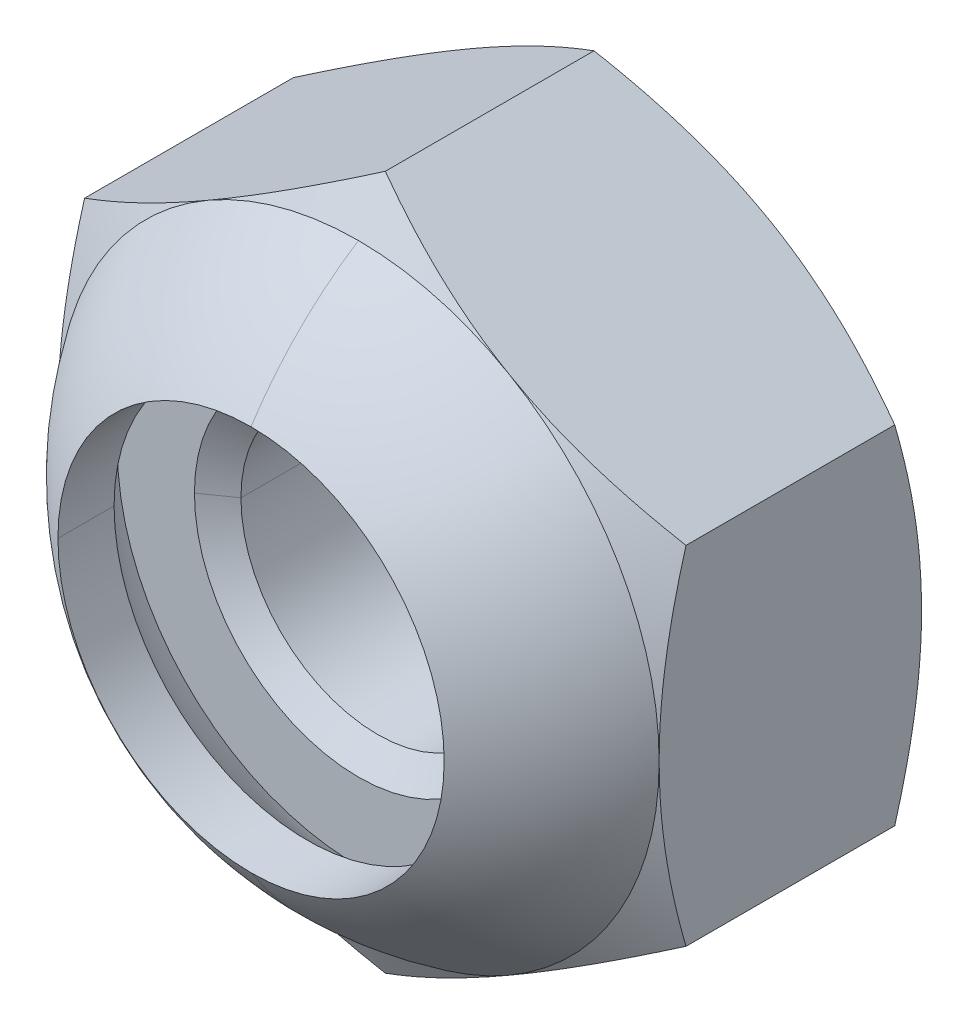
ISO-10303-21;
HEADER;
FILE_DESCRIPTION(('STEP AP214'),'2;1');
FILE_NAME('part.step','',(''),(''),'','','');
FILE_SCHEMA(('AUTOMOTIVE_DESIGN { 1 0 10303 214 1 1 1 1 }'));
ENDSEC;
DATA;
#1=APPLICATION_CONTEXT('core data for automotive mechanical design processes');
#2=APPLICATION_PROTOCOL_DEFINITION('international standard','automotive_design',2000,#1);
#3=PRODUCT_CONTEXT('',#1,'mechanical');
#4=PRODUCT('Part','Part','',(#3));
#5=PRODUCT_RELATED_PRODUCT_CATEGORY('part','',(#4));
#6=PRODUCT_DEFINITION_FORMATION('','',#4);
#7=PRODUCT_DEFINITION_CONTEXT('part definition',#1,'design');
#8=PRODUCT_DEFINITION('design','',#6,#7);
#9=PRODUCT_DEFINITION_SHAPE('','',#8);
#10=(LENGTH_UNIT() NAMED_UNIT(*) SI_UNIT(.MILLI.,.METRE.));
#11=(NAMED_UNIT(*) PLANE_ANGLE_UNIT() SI_UNIT($,.RADIAN.));
#12=(NAMED_UNIT(*) SI_UNIT($,.STERADIAN.) SOLID_ANGLE_UNIT());
#13=UNCERTAINTY_MEASURE_WITH_UNIT(LENGTH_MEASURE(1.E-05),#10,'distance_accuracy_value','');
#14=(GEOMETRIC_REPRESENTATION_CONTEXT(3) GLOBAL_UNCERTAINTY_ASSIGNED_CONTEXT((#13)) GLOBAL_UNIT_ASSIGNED_CONTEXT((#10,
#11,#12)) REPRESENTATION_CONTEXT('',''));
#15=CARTESIAN_POINT('',(0.,0.,0.));
#16=DIRECTION('',(0.,0.,1.));
#17=DIRECTION('',(1.,0.,0.));
#18=AXIS2_PLACEMENT_3D('',#15,#16,#17);
#19=CARTESIAN_POINT('',(0.,0.,-0.1228100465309));
#20=DIRECTION('',(0.,0.,-1.));
#21=DIRECTION('',(-1.,0.,0.));
#22=AXIS2_PLACEMENT_3D('',#19,#20,#21);
#23=CONICAL_SURFACE('',#22,2.962713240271,1.0471975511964);
#24=CARTESIAN_POINT('',(-2.74999999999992,0.,-1.38615247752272E-13));
#25=CARTESIAN_POINT('',(-2.7499794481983,-0.0666422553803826,2.30499517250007E-05));
#26=CARTESIAN_POINT('',(-2.74992308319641,-0.133284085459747,-0.00135381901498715));
#27=CARTESIAN_POINT('',(-2.74982096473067,-0.266161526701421,-0.00686232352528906));
#28=CARTESIAN_POINT('',(-2.74977516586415,-0.332397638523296,-0.0109818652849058));
#29=CARTESIAN_POINT('',(-2.74977480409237,-0.465126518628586,-0.0219710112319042));
#30=CARTESIAN_POINT('',(-2.74982090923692,-0.531617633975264,-0.0288604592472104));
#31=CARTESIAN_POINT('',(-2.74992501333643,-0.66549476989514,-0.0453428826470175));
#32=CARTESIAN_POINT('',(-2.7499832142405,-0.732874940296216,-0.0549829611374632));
#33=CARTESIAN_POINT('',(-2.75000879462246,-0.86474021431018,-0.0762646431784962));
#34=CARTESIAN_POINT('',(-2.74997947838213,-0.929239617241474,-0.0878182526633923));
#35=CARTESIAN_POINT('',(-2.74994216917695,-1.05876528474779,-0.113208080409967));
#36=CARTESIAN_POINT('',(-2.74993449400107,-1.12378547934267,-0.127075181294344));
#37=CARTESIAN_POINT('',(-2.74994000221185,-1.25472640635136,-0.157071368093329));
#38=CARTESIAN_POINT('',(-2.74995362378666,-1.3206376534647,-0.173241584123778));
#39=CARTESIAN_POINT('',(-2.74998183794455,-1.45369456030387,-0.207838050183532));
#40=CARTESIAN_POINT('',(-2.74999644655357,-1.52082785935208,-0.226311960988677));
#41=CARTESIAN_POINT('',(-2.74999999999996,-1.58771324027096,-0.245620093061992));
#42=B_SPLINE_CURVE_WITH_KNOTS('',3,(#24,#25,#26,#27,#28,#29,#30,#31,#32,#33,#34,#35,#36,#37,#38,
#39,#40,#41),.UNSPECIFIED.,.F.,.F.,(4,2,2,2,2,2,2,2,4),(0.,0.199911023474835,0.398946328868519,
0.5994336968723,0.803584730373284,1.00012655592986,1.19953984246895,1.40311043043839,
1.61196450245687),.UNSPECIFIED.);
#43=CARTESIAN_POINT('',(-2.75,0.,0.));
#44=VERTEX_POINT('',#43);
#45=CARTESIAN_POINT('',(-2.75,-1.587713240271,-0.2456200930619));
#46=VERTEX_POINT('',#45);
#47=EDGE_CURVE('E858',#44,#46,#42,.T.);
#48=ORIENTED_EDGE('',*,*,#47,.T.);
#49=CARTESIAN_POINT('',(-2.74999999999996,-1.58771324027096,-0.245620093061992));
#50=CARTESIAN_POINT('',(-2.69227796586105,-1.62103454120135,-0.226379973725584));
#51=CARTESIAN_POINT('',(-2.63433510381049,-1.65446411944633,-0.207965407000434));
#52=CARTESIAN_POINT('',(-2.51952884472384,-1.72069779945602,-0.17348077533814));
#53=CARTESIAN_POINT('',(-2.46267634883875,-1.75349568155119,-0.15736234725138));
#54=CARTESIAN_POINT('',(-2.34978191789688,-1.81865379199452,-0.127461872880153));
#55=CARTESIAN_POINT('',(-2.29374812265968,-1.8510086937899,-0.113637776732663));
#56=CARTESIAN_POINT('',(-2.18218331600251,-1.91548012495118,-0.088331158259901));
#57=CARTESIAN_POINT('',(-2.12665744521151,-1.94759290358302,-0.0768165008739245));
#58=CARTESIAN_POINT('',(-2.01244907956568,-2.01354513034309,-0.0554655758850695));
#59=CARTESIAN_POINT('',(-1.95374839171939,-2.0473901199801,-0.0457429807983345));
#60=CARTESIAN_POINT('',(-1.8371574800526,-2.11459753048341,-0.0291180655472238));
#61=CARTESIAN_POINT('',(-1.77927272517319,-2.14795708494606,-0.022166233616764));
#62=CARTESIAN_POINT('',(-1.6638115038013,-2.214600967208,-0.0110799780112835));
#63=CARTESIAN_POINT('',(-1.60623628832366,-2.24788375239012,-0.00692340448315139));
#64=CARTESIAN_POINT('',(-1.49077946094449,-2.31464269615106,-0.00136669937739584));
#65=CARTESIAN_POINT('',(-1.43289750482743,-2.34811911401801,2.31475700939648E-05));
#66=CARTESIAN_POINT('',(-1.37499999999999,-2.38156986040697,0.));
#67=B_SPLINE_CURVE_WITH_KNOTS('',3,(#49,#50,#51,#52,#53,#54,#55,#56,#57,#58,#59,#60,#61,#62,#63,
#64,#65,#66),.UNSPECIFIED.,.F.,.F.,(4,2,2,2,2,2,2,2,4),(0.,0.208117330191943,0.410845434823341,
0.609304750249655,0.804774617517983,1.01008463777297,1.21154093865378,1.41138145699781,
1.61196345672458),.UNSPECIFIED.);
#68=CARTESIAN_POINT('',(-1.375,-2.381569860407,0.));
#69=VERTEX_POINT('',#68);
#70=EDGE_CURVE('E804',#46,#69,#67,.T.);
#71=ORIENTED_EDGE('',*,*,#70,.T.);
#72=CARTESIAN_POINT('',(0.,0.,0.));
#73=DIRECTION('',(0.,0.,1.));
#74=DIRECTION('',(-1.,0.,0.));
#75=AXIS2_PLACEMENT_3D('',#72,#73,#74);
#76=CIRCLE('',#75,2.75);
#77=EDGE_CURVE('E359',#44,#69,#76,.T.);
#78=ORIENTED_EDGE('',*,*,#77,.F.);
#79=EDGE_LOOP('',(#48,#71,#78));
#80=FACE_BOUND('',#79,.T.);
#81=ADVANCED_FACE('F17',(#80),#23,.T.);
#82=CARTESIAN_POINT('',(0.,0.,-0.1228100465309));
#83=DIRECTION('',(0.,0.,-1.));
#84=DIRECTION('',(-1.,0.,0.));
#85=AXIS2_PLACEMENT_3D('',#82,#83,#84);
#86=CONICAL_SURFACE('',#85,2.962713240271,1.0471975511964);
#87=CARTESIAN_POINT('',(0.,0.,0.));
#88=DIRECTION('',(0.,0.,1.));
#89=DIRECTION('',(-0.500000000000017,-0.866025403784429,0.));
#90=AXIS2_PLACEMENT_3D('',#87,#88,#89);
#91=CIRCLE('',#90,2.75);
#92=CARTESIAN_POINT('',(0.,-2.75,0.));
#93=VERTEX_POINT('',#92);
#94=EDGE_CURVE('E282',#69,#93,#91,.T.);
#95=ORIENTED_EDGE('',*,*,#94,.F.);
#96=CARTESIAN_POINT('',(-1.37499999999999,-2.38156986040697,0.));
#97=CARTESIAN_POINT('',(-1.31873949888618,-2.41403019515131,2.09547123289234E-05));
#98=CARTESIAN_POINT('',(-1.26246640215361,-2.4464676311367,-0.00129150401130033));
#99=CARTESIAN_POINT('',(-1.15023022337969,-2.51118180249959,-0.00653992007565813));
#100=CARTESIAN_POINT('',(-1.0942667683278,-2.54345868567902,-0.0104660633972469));
#101=CARTESIAN_POINT('',(-0.982148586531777,-2.60821857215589,-0.0209376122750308));
#102=CARTESIAN_POINT('',(-0.92599552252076,-2.64070132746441,-0.027502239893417));
#103=CARTESIAN_POINT('',(-0.812943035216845,-2.70610268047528,-0.043208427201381));
#104=CARTESIAN_POINT('',(-0.756048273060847,-2.73901865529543,-0.0523940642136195));
#105=CARTESIAN_POINT('',(-0.64184458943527,-2.8049787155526,-0.0731899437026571));
#106=CARTESIAN_POINT('',(-0.584538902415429,-2.8380195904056,-0.0848279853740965));
#107=CARTESIAN_POINT('',(-0.469498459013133,-2.90436890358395,-0.110503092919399));
#108=CARTESIAN_POINT('',(-0.411769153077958,-2.93767448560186,-0.124571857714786));
#109=CARTESIAN_POINT('',(-0.295534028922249,-3.00476211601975,-0.155086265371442));
#110=CARTESIAN_POINT('',(-0.237037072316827,-3.03853964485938,-0.171575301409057));
#111=CARTESIAN_POINT('',(-0.118944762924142,-3.10673673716,-0.206922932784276));
#112=CARTESIAN_POINT('',(-0.0593608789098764,-3.14114988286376,-0.225832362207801));
#113=CARTESIAN_POINT('',(0.,-3.17542648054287,-0.24562009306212));
#114=B_SPLINE_CURVE_WITH_KNOTS('',3,(#96,#97,#98,#99,#100,#101,#102,#103,#104,#105,#106,#107,
#108,#109,#110,#111,#112,#113),.UNSPECIFIED.,.F.,.F.,(4,2,2,2,2,2,2,2,4),(0.,0.194844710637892,
0.388961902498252,0.584519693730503,0.783582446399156,0.985036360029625,1.18934892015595,
1.39791583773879,1.61195696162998),.UNSPECIFIED.);
#115=CARTESIAN_POINT('',(0.,-3.175426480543,-0.2456200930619));
#116=VERTEX_POINT('',#115);
#117=EDGE_CURVE('E684',#69,#116,#114,.T.);
#118=ORIENTED_EDGE('',*,*,#117,.T.);
#119=CARTESIAN_POINT('',(0.,-3.17542648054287,-0.24562009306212));
#120=CARTESIAN_POINT('',(0.0577181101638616,-3.14209838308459,-0.2263799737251));
#121=CARTESIAN_POINT('',(0.115640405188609,-3.10863318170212,-0.207965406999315));
#122=CARTESIAN_POINT('',(0.230403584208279,-3.04232488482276,-0.173480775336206));
#123=CARTESIAN_POINT('',(0.28723363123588,-3.00948812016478,-0.157362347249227));
#124=CARTESIAN_POINT('',(0.400109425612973,-2.94429773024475,-0.127461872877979));
#125=CARTESIAN_POINT('',(0.45614649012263,-2.91194849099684,-0.113637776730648));
#126=CARTESIAN_POINT('',(0.567762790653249,-2.84756624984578,-0.0883311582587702));
#127=CARTESIAN_POINT('',(0.623336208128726,-2.81553582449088,-0.0768165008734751));
#128=CARTESIAN_POINT('',(0.737556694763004,-2.74960459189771,-0.0554655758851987));
#129=CARTESIAN_POINT('',(0.796217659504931,-2.71569079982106,-0.0457429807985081));
#130=CARTESIAN_POINT('',(0.912716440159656,-2.64832381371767,-0.0291180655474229));
#131=CARTESIAN_POINT('',(0.970549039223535,-2.61487392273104,-0.0221662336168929));
#132=CARTESIAN_POINT('',(1.08599494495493,-2.5482035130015,-0.011079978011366));
#133=CARTESIAN_POINT('',(1.14360629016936,-2.51498330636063,-0.00692340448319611));
#134=CARTESIAN_POINT('',(1.25914964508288,-2.44837423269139,-0.00136669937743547));
#135=CARTESIAN_POINT('',(1.31708205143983,-2.41498519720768,2.31475700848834E-05));
#136=CARTESIAN_POINT('',(1.37499999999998,-2.38156986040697,0.));
#137=B_SPLINE_CURVE_WITH_KNOTS('',3,(#119,#120,#121,#122,#123,#124,#125,#126,#127,#128,#129,
#130,#131,#132,#133,#134,#135,#136),.UNSPECIFIED.,.F.,.F.,(4,2,2,2,2,2,2,2,4),(0.,
0.208117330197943,0.410845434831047,0.609304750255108,0.804774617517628,1.01008463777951,
1.21154093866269,1.41138145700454,1.61196345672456),.UNSPECIFIED.);
#138=CARTESIAN_POINT('',(1.375,-2.381569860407,0.));
#139=VERTEX_POINT('',#138);
#140=EDGE_CURVE('E712',#116,#139,#137,.T.);
#141=ORIENTED_EDGE('',*,*,#140,.T.);
#142=CARTESIAN_POINT('',(0.,0.,0.));
#143=DIRECTION('',(0.,0.,1.));
#144=DIRECTION('',(0.,-1.,0.));
#145=AXIS2_PLACEMENT_3D('',#142,#143,#144);
#146=CIRCLE('',#145,2.75);
#147=EDGE_CURVE('E309',#93,#139,#146,.T.);
#148=ORIENTED_EDGE('',*,*,#147,.F.);
#149=EDGE_LOOP('',(#95,#118,#141,#148));
#150=FACE_BOUND('',#149,.T.);
#151=ADVANCED_FACE('F688',(#150),#86,.T.);
#152=CARTESIAN_POINT('',(0.,0.,-2.4));
#153=DIRECTION('',(0.,0.,1.));
#154=DIRECTION('',(1.,0.,0.));
#155=AXIS2_PLACEMENT_3D('',#152,#153,#154);
#156=CYLINDRICAL_SURFACE('',#155,1.25);
#157=CARTESIAN_POINT('',(0.,0.,-2.199548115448));
#158=DIRECTION('',(0.,0.,1.));
#159=DIRECTION('',(1.,0.,0.));
#160=AXIS2_PLACEMENT_3D('',#157,#158,#159);
#161=CIRCLE('',#160,1.25);
#162=CARTESIAN_POINT('',(1.25,0.,-2.199548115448));
#163=VERTEX_POINT('',#162);
#164=CARTESIAN_POINT('',(-1.25,0.,-2.199548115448));
#165=VERTEX_POINT('',#164);
#166=EDGE_CURVE('E274',#163,#165,#161,.T.);
#167=ORIENTED_EDGE('',*,*,#166,.F.);
#168=DIRECTION('',(0.,0.,-1.));
#169=VECTOR('',#168,1.);
#170=CARTESIAN_POINT('',(1.25,0.,-0.1750518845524));
#171=LINE('',#170,#169);
#172=CARTESIAN_POINT('',(1.25,0.,-0.1750518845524));
#173=VERTEX_POINT('',#172);
#174=EDGE_CURVE('E247',#173,#163,#171,.T.);
#175=ORIENTED_EDGE('',*,*,#174,.F.);
#176=CARTESIAN_POINT('',(0.,0.,-0.1750518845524));
#177=DIRECTION('',(0.,0.,-1.));
#178=DIRECTION('',(-1.,0.,0.));
#179=AXIS2_PLACEMENT_3D('',#176,#177,#178);
#180=CIRCLE('',#179,1.25);
#181=CARTESIAN_POINT('',(-1.25,0.,-0.1750518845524));
#182=VERTEX_POINT('',#181);
#183=EDGE_CURVE('E191',#182,#173,#180,.T.);
#184=ORIENTED_EDGE('',*,*,#183,.F.);
#185=DIRECTION('',(0.,0.,-1.));
#186=VECTOR('',#185,1.);
#187=CARTESIAN_POINT('',(-1.25,0.,-0.1750518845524));
#188=LINE('',#187,#186);
#189=EDGE_CURVE('E252',#182,#165,#188,.T.);
#190=ORIENTED_EDGE('',*,*,#189,.T.);
#191=EDGE_LOOP('',(#167,#175,#184,#190));
#192=FACE_BOUND('',#191,.T.);
#193=ADVANCED_FACE('F696',(#192),#156,.F.);
#194=CARTESIAN_POINT('',(0.,0.,-0.1228100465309));
#195=DIRECTION('',(0.,0.,-1.));
#196=DIRECTION('',(-1.,0.,0.));
#197=AXIS2_PLACEMENT_3D('',#194,#195,#196);
#198=CONICAL_SURFACE('',#197,2.962713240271,1.0471975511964);
#199=CARTESIAN_POINT('',(2.74999999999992,0.,-1.38615247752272E-13));
#200=CARTESIAN_POINT('',(2.74997919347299,0.066838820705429,2.33281187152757E-05));
#201=CARTESIAN_POINT('',(2.74992211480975,0.133677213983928,-0.00136151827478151));
#202=CARTESIAN_POINT('',(2.74981874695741,0.266943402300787,-0.00690200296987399));
#203=CARTESIAN_POINT('',(2.74977241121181,0.333371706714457,-0.0110453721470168));
#204=CARTESIAN_POINT('',(2.7497722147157,0.466486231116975,-0.02209810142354));
#205=CARTESIAN_POINT('',(2.74981903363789,0.533170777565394,-0.0290274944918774));
#206=CARTESIAN_POINT('',(2.74992547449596,0.667441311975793,-0.0456053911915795));
#207=CARTESIAN_POINT('',(2.74998531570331,0.735021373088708,-0.0553014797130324));
#208=CARTESIAN_POINT('',(2.75001288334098,0.866897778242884,-0.0766434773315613));
#209=CARTESIAN_POINT('',(2.74998445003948,0.931210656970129,-0.0881879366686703));
#210=CARTESIAN_POINT('',(2.74994761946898,1.06035990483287,-0.113544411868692));
#211=CARTESIAN_POINT('',(2.74993952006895,1.12519025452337,-0.127387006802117));
#212=CARTESIAN_POINT('',(2.74994357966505,1.2557440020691,-0.157319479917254));
#213=CARTESIAN_POINT('',(2.74995616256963,1.32145801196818,-0.173450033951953));
#214=CARTESIAN_POINT('',(2.74998260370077,1.45410938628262,-0.207952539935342));
#215=CARTESIAN_POINT('',(2.7499964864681,1.52103452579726,-0.226371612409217));
#216=CARTESIAN_POINT('',(2.74999999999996,1.58771324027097,-0.245620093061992));
#217=B_SPLINE_CURVE_WITH_KNOTS('',3,(#199,#200,#201,#202,#203,#204,#205,#206,#207,#208,#209,
#210,#211,#212,#213,#214,#215,#216),.UNSPECIFIED.,.F.,.F.,(4,2,2,2,2,2,2,2,4),(0.,
0.200500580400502,0.400115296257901,0.601191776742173,0.805959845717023,1.00194648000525,
1.20078777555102,1.40375560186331,1.61196426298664),.UNSPECIFIED.);
#218=CARTESIAN_POINT('',(2.75,0.,0.));
#219=VERTEX_POINT('',#218);
#220=CARTESIAN_POINT('',(2.75,1.587713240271,-0.2456200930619));
#221=VERTEX_POINT('',#220);
#222=EDGE_CURVE('E548',#219,#221,#217,.T.);
#223=ORIENTED_EDGE('',*,*,#222,.T.);
#224=CARTESIAN_POINT('',(2.74999999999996,1.58771324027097,-0.245620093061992));
#225=CARTESIAN_POINT('',(2.69227796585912,1.62103454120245,-0.226379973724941));
#226=CARTESIAN_POINT('',(2.63433510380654,1.65446411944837,-0.207965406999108));
#227=CARTESIAN_POINT('',(2.51952884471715,1.72069779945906,-0.173480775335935));
#228=CARTESIAN_POINT('',(2.46267634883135,1.7534956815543,-0.157362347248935));
#229=CARTESIAN_POINT('',(2.34978191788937,1.8186537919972,-0.127461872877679));
#230=CARTESIAN_POINT('',(2.29374812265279,1.85100869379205,-0.113637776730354));
#231=CARTESIAN_POINT('',(2.18218331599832,1.91548012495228,-0.0883311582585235));
#232=CARTESIAN_POINT('',(2.12665744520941,1.94759290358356,-0.0768165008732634));
#233=CARTESIAN_POINT('',(2.0124490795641,2.01354513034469,-0.0554655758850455));
#234=CARTESIAN_POINT('',(1.95374839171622,2.04739011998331,-0.0457429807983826));
#235=CARTESIAN_POINT('',(1.83715748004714,2.11459753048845,-0.0291180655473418));
#236=CARTESIAN_POINT('',(1.77927272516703,2.14795708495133,-0.0221662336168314));
#237=CARTESIAN_POINT('',(1.66381150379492,2.21460096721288,-0.0110799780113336));
#238=CARTESIAN_POINT('',(1.60623628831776,2.24788375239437,-0.00692340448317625));
#239=CARTESIAN_POINT('',(1.49077946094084,2.31464269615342,-0.00136669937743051));
#240=CARTESIAN_POINT('',(1.43289750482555,2.3481191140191,2.31475700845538E-05));
#241=CARTESIAN_POINT('',(1.37499999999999,2.38156986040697,0.));
#242=B_SPLINE_CURVE_WITH_KNOTS('',3,(#224,#225,#226,#227,#228,#229,#230,#231,#232,#233,#234,
#235,#236,#237,#238,#239,#240,#241),.UNSPECIFIED.,.F.,.F.,(4,2,2,2,2,2,2,2,4),(0.,
0.208117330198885,0.410845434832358,0.609304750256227,0.804774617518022,1.01008463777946,
1.21154093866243,1.41138145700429,1.61196345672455),.UNSPECIFIED.);
#243=CARTESIAN_POINT('',(1.375,2.381569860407,0.));
#244=VERTEX_POINT('',#243);
#245=EDGE_CURVE('E757',#221,#244,#242,.T.);
#246=ORIENTED_EDGE('',*,*,#245,.T.);
#247=CARTESIAN_POINT('',(0.,0.,0.));
#248=DIRECTION('',(0.,0.,1.));
#249=DIRECTION('',(1.,0.,0.));
#250=AXIS2_PLACEMENT_3D('',#247,#248,#249);
#251=CIRCLE('',#250,2.75);
#252=EDGE_CURVE('E722',#219,#244,#251,.T.);
#253=ORIENTED_EDGE('',*,*,#252,.F.);
#254=EDGE_LOOP('',(#223,#246,#253));
#255=FACE_BOUND('',#254,.T.);
#256=ADVANCED_FACE('F399',(#255),#198,.T.);
#257=CARTESIAN_POINT('',(0.,0.,-0.1228100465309));
#258=DIRECTION('',(0.,0.,-1.));
#259=DIRECTION('',(-1.,0.,0.));
#260=AXIS2_PLACEMENT_3D('',#257,#258,#259);
#261=CONICAL_SURFACE('',#260,2.962713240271,1.0471975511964);
#262=CARTESIAN_POINT('',(0.,0.,0.));
#263=DIRECTION('',(0.,0.,1.));
#264=DIRECTION('',(0.500000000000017,0.866025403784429,0.));
#265=AXIS2_PLACEMENT_3D('',#262,#263,#264);
#266=CIRCLE('',#265,2.75);
#267=CARTESIAN_POINT('',(0.,2.75,0.));
#268=VERTEX_POINT('',#267);
#269=EDGE_CURVE('E226',#244,#268,#266,.T.);
#270=ORIENTED_EDGE('',*,*,#269,.F.);
#271=CARTESIAN_POINT('',(1.37499999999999,2.38156986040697,0.));
#272=CARTESIAN_POINT('',(1.31873949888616,2.41403019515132,2.09547123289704E-05));
#273=CARTESIAN_POINT('',(1.26246640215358,2.44646763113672,-0.00129150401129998));
#274=CARTESIAN_POINT('',(1.15023022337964,2.51118180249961,-0.00653992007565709));
#275=CARTESIAN_POINT('',(1.09426676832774,2.54345868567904,-0.0104660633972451));
#276=CARTESIAN_POINT('',(0.982148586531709,2.60821857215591,-0.0209376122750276));
#277=CARTESIAN_POINT('',(0.925995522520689,2.64070132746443,-0.0275022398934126));
#278=CARTESIAN_POINT('',(0.81294303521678,2.70610268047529,-0.0432084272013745));
#279=CARTESIAN_POINT('',(0.756048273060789,2.73901865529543,-0.0523940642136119));
#280=CARTESIAN_POINT('',(0.641844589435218,2.8049787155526,-0.0731899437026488));
#281=CARTESIAN_POINT('',(0.584538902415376,2.8380195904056,-0.084827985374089));
#282=CARTESIAN_POINT('',(0.469498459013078,2.90436890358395,-0.110503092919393));
#283=CARTESIAN_POINT('',(0.411769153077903,2.93767448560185,-0.12457185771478));
#284=CARTESIAN_POINT('',(0.295534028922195,3.00476211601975,-0.155086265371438));
#285=CARTESIAN_POINT('',(0.237037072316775,3.03853964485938,-0.171575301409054));
#286=CARTESIAN_POINT('',(0.118944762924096,3.10673673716,-0.206922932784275));
#287=CARTESIAN_POINT('',(0.0593608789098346,3.14114988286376,-0.225832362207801));
#288=CARTESIAN_POINT('',(0.,3.17542648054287,-0.24562009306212));
#289=B_SPLINE_CURVE_WITH_KNOTS('',3,(#271,#272,#273,#274,#275,#276,#277,#278,#279,#280,#281,
#282,#283,#284,#285,#286,#287,#288),.UNSPECIFIED.,.F.,.F.,(4,2,2,2,2,2,2,2,4),(0.,
0.194844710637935,0.388961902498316,0.584519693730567,0.783582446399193,0.985036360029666,
1.189348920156,1.39791583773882,1.61195696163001),.UNSPECIFIED.);
#290=CARTESIAN_POINT('',(0.,3.175426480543,-0.2456200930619));
#291=VERTEX_POINT('',#290);
#292=EDGE_CURVE('E449',#244,#291,#289,.T.);
#293=ORIENTED_EDGE('',*,*,#292,.T.);
#294=CARTESIAN_POINT('',(0.,3.17542648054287,-0.24562009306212));
#295=CARTESIAN_POINT('',(-0.0577181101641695,3.14209838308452,-0.226379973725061));
#296=CARTESIAN_POINT('',(-0.115640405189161,3.10863318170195,-0.207965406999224));
#297=CARTESIAN_POINT('',(-0.230403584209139,3.04232488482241,-0.173480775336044));
#298=CARTESIAN_POINT('',(-0.287233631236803,3.00948812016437,-0.157362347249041));
#299=CARTESIAN_POINT('',(-0.400109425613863,2.94429773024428,-0.12746187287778));
#300=CARTESIAN_POINT('',(-0.456146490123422,2.91194849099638,-0.113637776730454));
#301=CARTESIAN_POINT('',(-0.56776279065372,2.84756624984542,-0.0883311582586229));
#302=CARTESIAN_POINT('',(-0.623336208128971,2.81553582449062,-0.0768165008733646));
#303=CARTESIAN_POINT('',(-0.737556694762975,2.7496045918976,-0.0554655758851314));
#304=CARTESIAN_POINT('',(-0.796217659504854,2.71569079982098,-0.0457429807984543));
#305=CARTESIAN_POINT('',(-0.912716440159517,2.64832381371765,-0.0291180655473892));
#306=CARTESIAN_POINT('',(-0.970549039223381,2.61487392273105,-0.0221662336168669));
#307=CARTESIAN_POINT('',(-1.08599494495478,2.54820351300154,-0.011079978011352));
#308=CARTESIAN_POINT('',(-1.14360629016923,2.51498330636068,-0.00692340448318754));
#309=CARTESIAN_POINT('',(-1.2591496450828,2.44837423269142,-0.00136669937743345));
#310=CARTESIAN_POINT('',(-1.31708205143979,2.4149851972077,2.3147570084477E-05));
#311=CARTESIAN_POINT('',(-1.37499999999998,2.38156986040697,0.));
#312=B_SPLINE_CURVE_WITH_KNOTS('',3,(#294,#295,#296,#297,#298,#299,#300,#301,#302,#303,#304,
#305,#306,#307,#308,#309,#310,#311),.UNSPECIFIED.,.F.,.F.,(4,2,2,2,2,2,2,2,4),(0.,
0.20811733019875,0.410845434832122,0.609304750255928,0.804774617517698,1.0100846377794,
1.2115409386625,1.41138145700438,1.61196345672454),.UNSPECIFIED.);
#313=CARTESIAN_POINT('',(-1.375,2.381569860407,0.));
#314=VERTEX_POINT('',#313);
#315=EDGE_CURVE('E53',#291,#314,#312,.T.);
#316=ORIENTED_EDGE('',*,*,#315,.T.);
#317=CARTESIAN_POINT('',(0.,0.,0.));
#318=DIRECTION('',(0.,0.,1.));
#319=DIRECTION('',(0.,1.,0.));
#320=AXIS2_PLACEMENT_3D('',#317,#318,#319);
#321=CIRCLE('',#320,2.75);
#322=EDGE_CURVE('E261',#268,#314,#321,.T.);
#323=ORIENTED_EDGE('',*,*,#322,.F.);
#324=EDGE_LOOP('',(#270,#293,#316,#323));
#325=FACE_BOUND('',#324,.T.);
#326=ADVANCED_FACE('F398',(#325),#261,.T.);
#327=CARTESIAN_POINT('',(0.,0.,-2.277189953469));
#328=DIRECTION('',(0.,0.,1.));
#329=DIRECTION('',(1.,0.,0.));
#330=AXIS2_PLACEMENT_3D('',#327,#328,#329);
#331=CONICAL_SURFACE('',#330,2.962713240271,1.0471975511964);
#332=CARTESIAN_POINT('',(1.3749999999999,2.38156986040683,-2.4));
#333=CARTESIAN_POINT('',(1.03801903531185,2.57612591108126,-2.4));
#334=CARTESIAN_POINT('',(0.682169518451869,2.78157572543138,-2.33407648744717));
#335=CARTESIAN_POINT('',(0.360084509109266,2.96753159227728,-2.27440807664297));
#336=CARTESIAN_POINT('',(-1.97324795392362E-13,3.17542648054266,-2.154379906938));
#337=B_SPLINE_CURVE_WITH_KNOTS('',2,(#332,#333,#334,#335,#336),.UNSPECIFIED.,.F.,.F.,(3,2,3),
(0.,0.5,1.),.UNSPECIFIED.);
#338=CARTESIAN_POINT('',(1.375,2.381569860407,-2.4));
#339=VERTEX_POINT('',#338);
#340=CARTESIAN_POINT('',(0.,3.175426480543,-2.154379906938));
#341=VERTEX_POINT('',#340);
#342=EDGE_CURVE('E373',#339,#341,#337,.T.);
#343=ORIENTED_EDGE('',*,*,#342,.F.);
#344=CARTESIAN_POINT('',(0.,0.,-2.4));
#345=DIRECTION('',(0.,0.,-1.));
#346=DIRECTION('',(-0.500000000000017,0.866025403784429,0.));
#347=AXIS2_PLACEMENT_3D('',#344,#345,#346);
#348=CIRCLE('',#347,2.75);
#349=CARTESIAN_POINT('',(-1.375,2.381569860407,-2.4));
#350=VERTEX_POINT('',#349);
#351=EDGE_CURVE('E1387',#350,#339,#348,.T.);
#352=ORIENTED_EDGE('',*,*,#351,.F.);
#353=CARTESIAN_POINT('',(0.,3.175426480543,-2.154379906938));
#354=CARTESIAN_POINT('',(-0.360360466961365,2.96737226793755,-2.27450006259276));
#355=CARTESIAN_POINT('',(-0.682183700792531,2.78156753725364,-2.334182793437));
#356=CARTESIAN_POINT('',(-1.03708546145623,2.57666491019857,-2.4));
#357=CARTESIAN_POINT('',(-1.3750000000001,2.38156986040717,-2.4));
#358=B_SPLINE_CURVE_WITH_KNOTS('',2,(#353,#354,#355,#356,#357),.UNSPECIFIED.,.F.,.F.,(3,2,3),
(0.,0.5,1.),.UNSPECIFIED.);
#359=EDGE_CURVE('E29',#341,#350,#358,.T.);
#360=ORIENTED_EDGE('',*,*,#359,.F.);
#361=EDGE_LOOP('',(#343,#352,#360));
#362=FACE_BOUND('',#361,.T.);
#363=ADVANCED_FACE('F389',(#362),#331,.T.);
#364=CARTESIAN_POINT('',(0.,0.,-2.277189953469));
#365=DIRECTION('',(0.,0.,1.));
#366=DIRECTION('',(1.,0.,0.));
#367=AXIS2_PLACEMENT_3D('',#364,#365,#366);
#368=CONICAL_SURFACE('',#367,2.962713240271,1.0471975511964);
#369=CARTESIAN_POINT('',(0.,0.,-2.4));
#370=DIRECTION('',(0.,0.,-1.));
#371=DIRECTION('',(-1.,0.,0.));
#372=AXIS2_PLACEMENT_3D('',#369,#370,#371);
#373=CIRCLE('',#372,2.75);
#374=CARTESIAN_POINT('',(-2.75,0.,-2.4));
#375=VERTEX_POINT('',#374);
#376=EDGE_CURVE('E305',#375,#350,#373,.T.);
#377=ORIENTED_EDGE('',*,*,#376,.F.);
#378=CARTESIAN_POINT('',(-2.74999999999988,0.,-2.39999999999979));
#379=CARTESIAN_POINT('',(-2.74997919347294,0.0668388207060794,-2.40002332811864));
#380=CARTESIAN_POINT('',(-2.74992211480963,0.133677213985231,-2.39863848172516));
#381=CARTESIAN_POINT('',(-2.74981874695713,0.266943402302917,-2.39309799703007));
#382=CARTESIAN_POINT('',(-2.74977241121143,0.333371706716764,-2.38895462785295));
#383=CARTESIAN_POINT('',(-2.74977221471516,0.466486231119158,-2.37790189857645));
#384=CARTESIAN_POINT('',(-2.7498190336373,0.533170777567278,-2.37097250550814));
#385=CARTESIAN_POINT('',(-2.74992547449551,0.667441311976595,-2.35439460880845));
#386=CARTESIAN_POINT('',(-2.74998531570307,0.735021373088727,-2.34469852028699));
#387=CARTESIAN_POINT('',(-2.75001288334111,0.866897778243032,-2.32335652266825));
#388=CARTESIAN_POINT('',(-2.74998445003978,0.931210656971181,-2.31181206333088));
#389=CARTESIAN_POINT('',(-2.7499476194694,1.0603599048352,-2.2864555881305));
#390=CARTESIAN_POINT('',(-2.74993952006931,1.12519025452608,-2.27261299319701));
#391=CARTESIAN_POINT('',(-2.74994357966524,1.25574400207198,-2.24268052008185));
#392=CARTESIAN_POINT('',(-2.74995616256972,1.32145801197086,-2.22654996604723));
#393=CARTESIAN_POINT('',(-2.74998260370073,1.45410938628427,-2.19204746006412));
#394=CARTESIAN_POINT('',(-2.74999648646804,1.52103452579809,-2.17362838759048));
#395=CARTESIAN_POINT('',(-2.74999999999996,1.58771324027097,-2.15437990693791));
#396=B_SPLINE_CURVE_WITH_KNOTS('',3,(#378,#379,#380,#381,#382,#383,#384,#385,#386,#387,#388,
#389,#390,#391,#392,#393,#394,#395),.UNSPECIFIED.,.F.,.F.,(4,2,2,2,2,2,2,2,4),(0.,
0.200500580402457,0.40011529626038,0.601191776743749,0.805959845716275,1.00194648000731,
1.20078777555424,1.40375560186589,1.61196426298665),.UNSPECIFIED.);
#397=CARTESIAN_POINT('',(-2.75,1.587713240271,-2.154379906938));
#398=VERTEX_POINT('',#397);
#399=EDGE_CURVE('E822',#375,#398,#396,.T.);
#400=ORIENTED_EDGE('',*,*,#399,.T.);
#401=CARTESIAN_POINT('',(-1.3750000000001,2.38156986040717,-2.4));
#402=CARTESIAN_POINT('',(-1.71198096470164,2.18701380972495,-2.4));
#403=CARTESIAN_POINT('',(-2.06783048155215,1.9815639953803,-2.33407648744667));
#404=CARTESIAN_POINT('',(-2.3899154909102,1.79560812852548,-2.27440807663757));
#405=CARTESIAN_POINT('',(-2.7500000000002,1.58771324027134,-2.154379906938));
#406=B_SPLINE_CURVE_WITH_KNOTS('',2,(#401,#402,#403,#404,#405),.UNSPECIFIED.,.F.,.F.,(3,2,3),
(0.,0.5,1.),.UNSPECIFIED.);
#407=EDGE_CURVE('E11',#350,#398,#406,.T.);
#408=ORIENTED_EDGE('',*,*,#407,.F.);
#409=EDGE_LOOP('',(#377,#400,#408));
#410=FACE_BOUND('',#409,.T.);
#411=ADVANCED_FACE('F334',(#410),#368,.T.);
#412=CARTESIAN_POINT('',(0.,3.175426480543,-2.4));
#413=DIRECTION('',(-0.500000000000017,0.866025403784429,0.));
#414=DIRECTION('',(0.,0.,1.));
#415=AXIS2_PLACEMENT_3D('',#412,#413,#414);
#416=PLANE('',#415);
#417=CARTESIAN_POINT('',(-1.37499999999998,2.38156986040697,0.));
#418=CARTESIAN_POINT('',(-1.43124172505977,2.34907700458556,2.09547123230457E-05));
#419=CARTESIAN_POINT('',(-1.48746991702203,2.31656179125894,-0.001291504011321));
#420=CARTESIAN_POINT('',(-1.59963212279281,2.25171949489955,-0.00653992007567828));
#421=CARTESIAN_POINT('',(-1.65556645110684,2.21939216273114,-0.0104660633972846));
#422=CARTESIAN_POINT('',(-1.76770924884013,2.15467491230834,-0.0209376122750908));
#423=CARTESIAN_POINT('',(-1.82391667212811,2.12228631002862,-0.0275022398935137));
#424=CARTESIAN_POINT('',(-1.93708214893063,2.05708066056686,-0.0432084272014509));
#425=CARTESIAN_POINT('',(-1.9940356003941,2.02426633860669,-0.0523940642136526));
#426=CARTESIAN_POINT('',(-2.10826053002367,1.95834307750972,-0.0731899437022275));
#427=CARTESIAN_POINT('',(-2.16552761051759,1.92523533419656,-0.0848279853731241));
#428=CARTESIAN_POINT('',(-2.28050802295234,1.85878204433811,-0.110503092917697));
#429=CARTESIAN_POINT('',(-2.33821615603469,1.82543978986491,-0.124571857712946));
#430=CARTESIAN_POINT('',(-2.45443331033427,1.75832103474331,-0.155086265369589));
#431=CARTESIAN_POINT('',(-2.51293398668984,1.72454994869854,-0.171575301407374));
#432=CARTESIAN_POINT('',(-2.63104055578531,1.65637755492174,-0.206922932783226));
#433=CARTESIAN_POINT('',(-2.69063515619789,1.62198297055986,-0.225832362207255));
#434=CARTESIAN_POINT('',(-2.74999999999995,1.58771324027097,-0.245620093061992));
#435=B_SPLINE_CURVE_WITH_KNOTS('',3,(#417,#418,#419,#420,#421,#422,#423,#424,#425,#426,#427,
#428,#429,#430,#431,#432,#433,#434),.UNSPECIFIED.,.F.,.F.,(4,2,2,2,2,2,2,2,4),(0.,
0.194844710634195,0.388961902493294,0.584519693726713,0.783582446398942,0.985036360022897,
1.18934892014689,1.39791583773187,1.61195696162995),.UNSPECIFIED.);
#436=CARTESIAN_POINT('',(-2.75,1.587713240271,-0.2456200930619));
#437=VERTEX_POINT('',#436);
#438=EDGE_CURVE('E366',#314,#437,#435,.T.);
#439=ORIENTED_EDGE('',*,*,#438,.F.);
#440=ORIENTED_EDGE('',*,*,#315,.F.);
#441=DIRECTION('',(0.,0.,-1.));
#442=VECTOR('',#441,1.);
#443=CARTESIAN_POINT('',(0.,3.175426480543,-0.2456200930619));
#444=LINE('',#443,#442);
#445=EDGE_CURVE('E408',#291,#341,#444,.T.);
#446=ORIENTED_EDGE('',*,*,#445,.T.);
#447=ORIENTED_EDGE('',*,*,#359,.T.);
#448=ORIENTED_EDGE('',*,*,#407,.T.);
#449=DIRECTION('',(0.,0.,-1.));
#450=VECTOR('',#449,1.);
#451=CARTESIAN_POINT('',(-2.75,1.587713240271,-0.2456200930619));
#452=LINE('',#451,#450);
#453=EDGE_CURVE('E1032',#437,#398,#452,.T.);
#454=ORIENTED_EDGE('',*,*,#453,.F.);
#455=EDGE_LOOP('',(#439,#440,#446,#447,#448,#454));
#456=FACE_BOUND('',#455,.T.);
#457=ADVANCED_FACE('F323',(#456),#416,.T.);
#458=CARTESIAN_POINT('',(2.75,1.587713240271,-2.4));
#459=DIRECTION('',(0.500000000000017,0.866025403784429,0.));
#460=DIRECTION('',(0.,0.,-1.));
#461=AXIS2_PLACEMENT_3D('',#458,#459,#460);
#462=PLANE('',#461);
#463=ORIENTED_EDGE('',*,*,#292,.F.);
#464=ORIENTED_EDGE('',*,*,#245,.F.);
#465=DIRECTION('',(0.,0.,-1.));
#466=VECTOR('',#465,1.);
#467=CARTESIAN_POINT('',(2.75,1.587713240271,-0.2456200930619));
#468=LINE('',#467,#466);
#469=CARTESIAN_POINT('',(2.75,1.587713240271,-2.154379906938));
#470=VERTEX_POINT('',#469);
#471=EDGE_CURVE('E745',#221,#470,#468,.T.);
#472=ORIENTED_EDGE('',*,*,#471,.T.);
#473=CARTESIAN_POINT('',(2.75,1.587713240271,-2.154379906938));
#474=CARTESIAN_POINT('',(2.38963953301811,1.7957674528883,-2.2745000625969));
#475=CARTESIAN_POINT('',(2.0678162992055,1.9815721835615,-2.33418279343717));
#476=CARTESIAN_POINT('',(1.71291453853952,2.18647481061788,-2.4));
#477=CARTESIAN_POINT('',(1.3749999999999,2.38156986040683,-2.4));
#478=B_SPLINE_CURVE_WITH_KNOTS('',2,(#473,#474,#475,#476,#477),.UNSPECIFIED.,.F.,.F.,(3,2,3),
(0.,0.5,1.),.UNSPECIFIED.);
#479=EDGE_CURVE('E462',#470,#339,#478,.T.);
#480=ORIENTED_EDGE('',*,*,#479,.T.);
#481=ORIENTED_EDGE('',*,*,#342,.T.);
#482=ORIENTED_EDGE('',*,*,#445,.F.);
#483=EDGE_LOOP('',(#463,#464,#472,#480,#481,#482));
#484=FACE_BOUND('',#483,.T.);
#485=ADVANCED_FACE('F333',(#484),#462,.T.);
#486=CARTESIAN_POINT('',(0.,0.,-2.277189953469));
#487=DIRECTION('',(0.,0.,1.));
#488=DIRECTION('',(1.,0.,0.));
#489=AXIS2_PLACEMENT_3D('',#486,#487,#488);
#490=CONICAL_SURFACE('',#489,2.962713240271,1.0471975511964);
#491=CARTESIAN_POINT('',(2.74999999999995,1.58771324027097,-2.15437990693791));
#492=CARTESIAN_POINT('',(2.74999608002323,1.52109897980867,-2.17360988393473));
#493=CARTESIAN_POINT('',(2.74997552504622,1.45423960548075,-2.1920151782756));
#494=CARTESIAN_POINT('',(2.7499324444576,1.32176732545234,-2.22648378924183));
#495=CARTESIAN_POINT('',(2.74990998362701,1.25616695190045,-2.24259539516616));
#496=CARTESIAN_POINT('',(2.74989126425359,1.12588644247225,-2.27248474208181));
#497=CARTESIAN_POINT('',(2.74989446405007,1.06121600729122,-2.28630447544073));
#498=CARTESIAN_POINT('',(2.74994586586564,0.932429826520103,-2.3116048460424));
#499=CARTESIAN_POINT('',(2.74999338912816,0.868320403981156,-2.32311758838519));
#500=CARTESIAN_POINT('',(2.75000555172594,0.736435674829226,-2.34447876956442));
#501=CARTESIAN_POINT('',(2.74996580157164,0.668641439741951,-2.3542111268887));
#502=CARTESIAN_POINT('',(2.74987356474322,0.533997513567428,-2.37085270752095));
#503=CARTESIAN_POINT('',(2.74982133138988,0.467154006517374,-2.37781153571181));
#504=CARTESIAN_POINT('',(2.74980602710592,0.333772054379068,-2.38890891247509));
#505=CARTESIAN_POINT('',(2.74984224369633,0.267235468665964,-2.39306965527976));
#506=CARTESIAN_POINT('',(2.74992896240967,0.133799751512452,-2.3986319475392));
#507=CARTESIAN_POINT('',(2.74997951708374,0.0669001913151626,-2.40002319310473));
#508=CARTESIAN_POINT('',(2.74999999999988,0.,-2.39999999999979));
#509=B_SPLINE_CURVE_WITH_KNOTS('',3,(#491,#492,#493,#494,#495,#496,#497,#498,#499,#500,#501,
#502,#503,#504,#505,#506,#507,#508),.UNSPECIFIED.,.F.,.F.,(4,2,2,2,2,2,2,2,4),(0.,
0.208007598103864,0.410631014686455,0.608988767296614,0.80435794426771,1.00977733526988,
1.21133736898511,1.4112791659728,1.6119634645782),.UNSPECIFIED.);
#510=CARTESIAN_POINT('',(2.75,0.,-2.4));
#511=VERTEX_POINT('',#510);
#512=EDGE_CURVE('E508',#470,#511,#509,.T.);
#513=ORIENTED_EDGE('',*,*,#512,.T.);
#514=CARTESIAN_POINT('',(0.,0.,-2.4));
#515=DIRECTION('',(0.,0.,-1.));
#516=DIRECTION('',(0.500000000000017,0.866025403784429,0.));
#517=AXIS2_PLACEMENT_3D('',#514,#515,#516);
#518=CIRCLE('',#517,2.75);
#519=EDGE_CURVE('E387',#339,#511,#518,.T.);
#520=ORIENTED_EDGE('',*,*,#519,.F.);
#521=ORIENTED_EDGE('',*,*,#479,.F.);
#522=EDGE_LOOP('',(#513,#520,#521));
#523=FACE_BOUND('',#522,.T.);
#524=ADVANCED_FACE('F479',(#523),#490,.T.);
#525=CARTESIAN_POINT('',(0.,0.,-2.277189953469));
#526=DIRECTION('',(0.,0.,1.));
#527=DIRECTION('',(1.,0.,0.));
#528=AXIS2_PLACEMENT_3D('',#525,#526,#527);
#529=CONICAL_SURFACE('',#528,2.962713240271,1.0471975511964);
#530=CARTESIAN_POINT('',(0.,0.,-2.4));
#531=DIRECTION('',(0.,0.,-1.));
#532=DIRECTION('',(1.,0.,0.));
#533=AXIS2_PLACEMENT_3D('',#530,#531,#532);
#534=CIRCLE('',#533,2.75);
#535=CARTESIAN_POINT('',(1.375,-2.381569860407,-2.4));
#536=VERTEX_POINT('',#535);
#537=EDGE_CURVE('E513',#511,#536,#534,.T.);
#538=ORIENTED_EDGE('',*,*,#537,.F.);
#539=CARTESIAN_POINT('',(2.74999999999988,0.,-2.39999999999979));
#540=CARTESIAN_POINT('',(2.74997944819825,-0.0666422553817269,-2.40002304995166));
#541=CARTESIAN_POINT('',(2.74992308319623,-0.133284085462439,-2.39864618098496));
#542=CARTESIAN_POINT('',(2.74982096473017,-0.266161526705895,-2.39313767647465));
#543=CARTESIAN_POINT('',(2.74977516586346,-0.332397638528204,-2.38901813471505));
#544=CARTESIAN_POINT('',(2.7497748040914,-0.465126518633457,-2.37802898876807));
#545=CARTESIAN_POINT('',(2.74982090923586,-0.531617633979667,-2.3711395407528));
#546=CARTESIAN_POINT('',(2.74992501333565,-0.665494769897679,-2.35465711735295));
#547=CARTESIAN_POINT('',(2.74998321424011,-0.732874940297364,-2.34501703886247));
#548=CARTESIAN_POINT('',(2.75000879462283,-0.86474021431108,-2.32373535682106));
#549=CARTESIAN_POINT('',(2.74997947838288,-0.929239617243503,-2.31218174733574));
#550=CARTESIAN_POINT('',(2.74994216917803,-1.05876528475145,-2.2867919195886));
#551=CARTESIAN_POINT('',(2.7499344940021,-1.12378547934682,-2.27292481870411));
#552=CARTESIAN_POINT('',(2.74994000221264,-1.25472640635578,-2.24292863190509));
#553=CARTESIAN_POINT('',(2.74995362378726,-1.3206376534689,-2.22675841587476));
#554=CARTESIAN_POINT('',(2.74998183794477,-1.45369456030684,-2.19216194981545));
#555=CARTESIAN_POINT('',(2.74999644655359,-1.52082785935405,-2.17368803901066));
#556=CARTESIAN_POINT('',(2.74999999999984,-1.58771324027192,-2.15437990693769));
#557=B_SPLINE_CURVE_WITH_KNOTS('',3,(#539,#540,#541,#542,#543,#544,#545,#546,#547,#548,#549,
#550,#551,#552,#553,#554,#555,#556),.UNSPECIFIED.,.F.,.F.,(4,2,2,2,2,2,2,2,4),(0.,
0.199911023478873,0.398946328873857,0.599433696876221,0.803584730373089,1.00012655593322,
1.19953984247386,1.40311043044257,1.61196450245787),.UNSPECIFIED.);
#558=CARTESIAN_POINT('',(2.75,-1.587713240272,-2.154379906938));
#559=VERTEX_POINT('',#558);
#560=EDGE_CURVE('E565',#511,#559,#557,.T.);
#561=ORIENTED_EDGE('',*,*,#560,.T.);
#562=CARTESIAN_POINT('',(1.3750000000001,-2.38156986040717,-2.4));
#563=CARTESIAN_POINT('',(1.71198096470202,-2.18701380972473,-2.4));
#564=CARTESIAN_POINT('',(2.06783048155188,-1.98156399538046,-2.33407648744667));
#565=CARTESIAN_POINT('',(2.38991549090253,-1.79560812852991,-2.27440807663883));
#566=CARTESIAN_POINT('',(2.74999999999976,-1.58771324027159,-2.154379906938));
#567=B_SPLINE_CURVE_WITH_KNOTS('',2,(#562,#563,#564,#565,#566),.UNSPECIFIED.,.F.,.F.,(3,2,3),
(0.,0.5,1.),.UNSPECIFIED.);
#568=EDGE_CURVE('E566',#536,#559,#567,.T.);
#569=ORIENTED_EDGE('',*,*,#568,.F.);
#570=EDGE_LOOP('',(#538,#561,#569));
#571=FACE_BOUND('',#570,.T.);
#572=ADVANCED_FACE('F488',(#571),#529,.T.);
#573=CARTESIAN_POINT('',(0.,0.,-2.277189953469));
#574=DIRECTION('',(0.,0.,1.));
#575=DIRECTION('',(1.,0.,0.));
#576=AXIS2_PLACEMENT_3D('',#573,#574,#575);
#577=CONICAL_SURFACE('',#576,2.962713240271,1.0471975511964);
#578=CARTESIAN_POINT('',(-1.3749999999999,-2.38156986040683,-2.4));
#579=CARTESIAN_POINT('',(-1.03801903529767,-2.57612591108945,-2.4));
#580=CARTESIAN_POINT('',(-0.682169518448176,-2.78157572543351,-2.33407648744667));
#581=CARTESIAN_POINT('',(-0.360084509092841,-2.96753159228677,-2.2744080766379));
#582=CARTESIAN_POINT('',(1.79977560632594E-13,-3.17542648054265,-2.154379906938));
#583=B_SPLINE_CURVE_WITH_KNOTS('',2,(#578,#579,#580,#581,#582),.UNSPECIFIED.,.F.,.F.,(3,2,3),
(0.,0.5,1.),.UNSPECIFIED.);
#584=CARTESIAN_POINT('',(-1.375,-2.381569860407,-2.4));
#585=VERTEX_POINT('',#584);
#586=CARTESIAN_POINT('',(0.,-3.175426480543,-2.154379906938));
#587=VERTEX_POINT('',#586);
#588=EDGE_CURVE('E626',#585,#587,#583,.T.);
#589=ORIENTED_EDGE('',*,*,#588,.F.);
#590=CARTESIAN_POINT('',(0.,0.,-2.4));
#591=DIRECTION('',(0.,0.,-1.));
#592=DIRECTION('',(0.500000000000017,-0.866025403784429,0.));
#593=AXIS2_PLACEMENT_3D('',#590,#591,#592);
#594=CIRCLE('',#593,2.75);
#595=EDGE_CURVE('E777',#536,#585,#594,.T.);
#596=ORIENTED_EDGE('',*,*,#595,.F.);
#597=CARTESIAN_POINT('',(0.,-3.17542648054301,-2.154379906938));
#598=CARTESIAN_POINT('',(0.360360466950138,-2.96737226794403,-2.27450006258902));
#599=CARTESIAN_POINT('',(0.682183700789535,-2.78156753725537,-2.33418279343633));
#600=CARTESIAN_POINT('',(1.03708546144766,-2.57666491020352,-2.4));
#601=CARTESIAN_POINT('',(1.3750000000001,-2.38156986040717,-2.4));
#602=B_SPLINE_CURVE_WITH_KNOTS('',2,(#597,#598,#599,#600,#601),.UNSPECIFIED.,.F.,.F.,(3,2,3),
(0.,0.5,1.),.UNSPECIFIED.);
#603=EDGE_CURVE('E944',#587,#536,#602,.T.);
#604=ORIENTED_EDGE('',*,*,#603,.F.);
#605=EDGE_LOOP('',(#589,#596,#604));
#606=FACE_BOUND('',#605,.T.);
#607=ADVANCED_FACE('F914',(#606),#577,.T.);
#608=CARTESIAN_POINT('',(0.,0.,-2.277189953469));
#609=DIRECTION('',(0.,0.,1.));
#610=DIRECTION('',(1.,0.,0.));
#611=AXIS2_PLACEMENT_3D('',#608,#609,#610);
#612=CONICAL_SURFACE('',#611,2.962713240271,1.0471975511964);
#613=CARTESIAN_POINT('',(-2.75,0.,-2.4));
#614=CARTESIAN_POINT('',(-2.75,-0.389689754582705,-2.4));
#615=CARTESIAN_POINT('',(-2.75,-0.79961067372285,-2.33424416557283));
#616=CARTESIAN_POINT('',(-2.75,-1.17104236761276,-2.27466242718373));
#617=CARTESIAN_POINT('',(-2.75,-1.587713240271,-2.154379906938));
#618=B_SPLINE_CURVE_WITH_KNOTS('',2,(#613,#614,#615,#616,#617),.UNSPECIFIED.,.F.,.F.,(3,2,3),
(0.,0.5,1.),.UNSPECIFIED.);
#619=CARTESIAN_POINT('',(-2.75,-1.587713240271,-2.154379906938));
#620=VERTEX_POINT('',#619);
#621=EDGE_CURVE('E818',#375,#620,#618,.T.);
#622=ORIENTED_EDGE('',*,*,#621,.F.);
#623=CARTESIAN_POINT('',(0.,0.,-2.4));
#624=DIRECTION('',(0.,0.,-1.));
#625=DIRECTION('',(-0.500000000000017,-0.866025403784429,0.));
#626=AXIS2_PLACEMENT_3D('',#623,#624,#625);
#627=CIRCLE('',#626,2.75);
#628=EDGE_CURVE('E773',#585,#375,#627,.T.);
#629=ORIENTED_EDGE('',*,*,#628,.F.);
#630=CARTESIAN_POINT('',(-2.75,-1.587713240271,-2.154379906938));
#631=CARTESIAN_POINT('',(-2.38963953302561,-1.79576745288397,-2.27450006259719));
#632=CARTESIAN_POINT('',(-2.06781629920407,-1.98157218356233,-2.3341827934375));
#633=CARTESIAN_POINT('',(-1.71291453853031,-2.1864748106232,-2.4));
#634=CARTESIAN_POINT('',(-1.3749999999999,-2.38156986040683,-2.4));
#635=B_SPLINE_CURVE_WITH_KNOTS('',2,(#630,#631,#632,#633,#634),.UNSPECIFIED.,.F.,.F.,(3,2,3),
(0.,0.5,1.),.UNSPECIFIED.);
#636=EDGE_CURVE('E796',#620,#585,#635,.T.);
#637=ORIENTED_EDGE('',*,*,#636,.F.);
#638=EDGE_LOOP('',(#622,#629,#637));
#639=FACE_BOUND('',#638,.T.);
#640=ADVANCED_FACE('F905',(#639),#612,.T.);
#641=CARTESIAN_POINT('',(0.,3.175426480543,-2.4));
#642=DIRECTION('',(0.,0.,-1.));
#643=DIRECTION('',(0.,-1.,0.));
#644=AXIS2_PLACEMENT_3D('',#641,#642,#643);
#645=PLANE('',#644);
#646=CARTESIAN_POINT('',(0.,0.,-2.4));
#647=DIRECTION('',(0.,0.,1.));
#648=DIRECTION('',(-1.,0.,0.));
#649=AXIS2_PLACEMENT_3D('',#646,#647,#648);
#650=CIRCLE('',#649,1.5);
#651=CARTESIAN_POINT('',(-1.5,0.,-2.4));
#652=VERTEX_POINT('',#651);
#653=CARTESIAN_POINT('',(1.5,0.,-2.4));
#654=VERTEX_POINT('',#653);
#655=EDGE_CURVE('E221',#652,#654,#650,.T.);
#656=ORIENTED_EDGE('',*,*,#655,.T.);
#657=CARTESIAN_POINT('',(0.,0.,-2.4));
#658=DIRECTION('',(0.,0.,1.));
#659=DIRECTION('',(1.,0.,0.));
#660=AXIS2_PLACEMENT_3D('',#657,#658,#659);
#661=CIRCLE('',#660,1.5);
#662=EDGE_CURVE('E288',#654,#652,#661,.T.);
#663=ORIENTED_EDGE('',*,*,#662,.T.);
#664=EDGE_LOOP('',(#656,#663));
#665=FACE_BOUND('',#664,.T.);
#666=ORIENTED_EDGE('',*,*,#376,.T.);
#667=ORIENTED_EDGE('',*,*,#351,.T.);
#668=ORIENTED_EDGE('',*,*,#519,.T.);
#669=ORIENTED_EDGE('',*,*,#537,.T.);
#670=ORIENTED_EDGE('',*,*,#595,.T.);
#671=ORIENTED_EDGE('',*,*,#628,.T.);
#672=EDGE_LOOP('',(#666,#667,#668,#669,#670,#671));
#673=FACE_BOUND('',#672,.T.);
#674=ADVANCED_FACE('F489',(#665,#673),#645,.T.);
#675=CARTESIAN_POINT('',(0.,0.,-25.03750572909));
#676=DIRECTION('',(0.,0.,1.));
#677=DIRECTION('',(1.,0.,0.));
#678=AXIS2_PLACEMENT_3D('',#675,#676,#677);
#679=CYLINDRICAL_SURFACE('',#678,1.5);
#680=DIRECTION('',(0.,0.,-1.));
#681=VECTOR('',#680,1.);
#682=CARTESIAN_POINT('',(-1.5,0.,-2.3746));
#683=LINE('',#682,#681);
#684=CARTESIAN_POINT('',(-1.5,0.,-2.3746));
#685=VERTEX_POINT('',#684);
#686=EDGE_CURVE('E217',#685,#652,#683,.T.);
#687=ORIENTED_EDGE('',*,*,#686,.F.);
#688=CARTESIAN_POINT('',(0.,0.,-2.3746));
#689=DIRECTION('',(0.,0.,-1.));
#690=DIRECTION('',(1.,0.,0.));
#691=AXIS2_PLACEMENT_3D('',#688,#689,#690);
#692=CIRCLE('',#691,1.5);
#693=CARTESIAN_POINT('',(1.5,0.,-2.3746));
#694=VERTEX_POINT('',#693);
#695=EDGE_CURVE('E227',#694,#685,#692,.T.);
#696=ORIENTED_EDGE('',*,*,#695,.F.);
#697=DIRECTION('',(0.,0.,-1.));
#698=VECTOR('',#697,1.);
#699=CARTESIAN_POINT('',(1.5,0.,-2.3746));
#700=LINE('',#699,#698);
#701=EDGE_CURVE('E222',#694,#654,#700,.T.);
#702=ORIENTED_EDGE('',*,*,#701,.T.);
#703=ORIENTED_EDGE('',*,*,#655,.F.);
#704=EDGE_LOOP('',(#687,#696,#702,#703));
#705=FACE_BOUND('',#704,.T.);
#706=ADVANCED_FACE('F432',(#705),#679,.F.);
#707=CARTESIAN_POINT('',(0.,0.,-25.03750572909));
#708=DIRECTION('',(0.,0.,1.));
#709=DIRECTION('',(1.,0.,0.));
#710=AXIS2_PLACEMENT_3D('',#707,#708,#709);
#711=CYLINDRICAL_SURFACE('',#710,1.5);
#712=ORIENTED_EDGE('',*,*,#662,.F.);
#713=ORIENTED_EDGE('',*,*,#701,.F.);
#714=CARTESIAN_POINT('',(0.,0.,-2.3746));
#715=DIRECTION('',(0.,0.,-1.));
#716=DIRECTION('',(-1.,0.,0.));
#717=AXIS2_PLACEMENT_3D('',#714,#715,#716);
#718=CIRCLE('',#717,1.5);
#719=EDGE_CURVE('E284',#685,#694,#718,.T.);
#720=ORIENTED_EDGE('',*,*,#719,.F.);
#721=ORIENTED_EDGE('',*,*,#686,.T.);
#722=EDGE_LOOP('',(#712,#713,#720,#721));
#723=FACE_BOUND('',#722,.T.);
#724=ADVANCED_FACE('F841',(#723),#711,.F.);
#725=CARTESIAN_POINT('',(0.,0.,-2.287074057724));
#726=DIRECTION('',(0.,0.,-1.));
#727=DIRECTION('',(-1.,0.,0.));
#728=AXIS2_PLACEMENT_3D('',#725,#726,#727);
#729=CONICAL_SURFACE('',#728,1.375,0.9599310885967);
#730=ORIENTED_EDGE('',*,*,#166,.T.);
#731=DIRECTION('',(0.819152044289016,0.,0.573576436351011));
#732=VECTOR('',#731,1.);
#733=CARTESIAN_POINT('',(-1.5,0.,-2.3746));
#734=LINE('',#733,#732);
#735=EDGE_CURVE('E231',#685,#165,#734,.T.);
#736=ORIENTED_EDGE('',*,*,#735,.F.);
#737=ORIENTED_EDGE('',*,*,#719,.T.);
#738=DIRECTION('',(-0.819152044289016,0.,0.573576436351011));
#739=VECTOR('',#738,1.);
#740=CARTESIAN_POINT('',(1.5,0.,-2.3746));
#741=LINE('',#740,#739);
#742=EDGE_CURVE('E232',#694,#163,#741,.T.);
#743=ORIENTED_EDGE('',*,*,#742,.T.);
#744=EDGE_LOOP('',(#730,#736,#737,#743));
#745=FACE_BOUND('',#744,.T.);
#746=ADVANCED_FACE('F839',(#745),#729,.F.);
#747=CARTESIAN_POINT('',(0.,0.,-2.287074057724));
#748=DIRECTION('',(0.,0.,-1.));
#749=DIRECTION('',(-1.,0.,0.));
#750=AXIS2_PLACEMENT_3D('',#747,#748,#749);
#751=CONICAL_SURFACE('',#750,1.375,0.9599310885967);
#752=ORIENTED_EDGE('',*,*,#742,.F.);
#753=ORIENTED_EDGE('',*,*,#695,.T.);
#754=ORIENTED_EDGE('',*,*,#735,.T.);
#755=CARTESIAN_POINT('',(0.,0.,-2.199548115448));
#756=DIRECTION('',(0.,0.,1.));
#757=DIRECTION('',(-1.,0.,0.));
#758=AXIS2_PLACEMENT_3D('',#755,#756,#757);
#759=CIRCLE('',#758,1.25);
#760=EDGE_CURVE('E251',#165,#163,#759,.T.);
#761=ORIENTED_EDGE('',*,*,#760,.T.);
#762=EDGE_LOOP('',(#752,#753,#754,#761));
#763=FACE_BOUND('',#762,.T.);
#764=ADVANCED_FACE('F920',(#763),#751,.F.);
#765=CARTESIAN_POINT('',(0.,0.,-2.4));
#766=DIRECTION('',(0.,0.,1.));
#767=DIRECTION('',(1.,0.,0.));
#768=AXIS2_PLACEMENT_3D('',#765,#766,#767);
#769=CYLINDRICAL_SURFACE('',#768,1.25);
#770=ORIENTED_EDGE('',*,*,#189,.F.);
#771=CARTESIAN_POINT('',(0.,0.,-0.1750518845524));
#772=DIRECTION('',(0.,0.,-1.));
#773=DIRECTION('',(1.,0.,0.));
#774=AXIS2_PLACEMENT_3D('',#771,#772,#773);
#775=CIRCLE('',#774,1.25);
#776=EDGE_CURVE('E267',#173,#182,#775,.T.);
#777=ORIENTED_EDGE('',*,*,#776,.F.);
#778=ORIENTED_EDGE('',*,*,#174,.T.);
#779=ORIENTED_EDGE('',*,*,#760,.F.);
#780=EDGE_LOOP('',(#770,#777,#778,#779));
#781=FACE_BOUND('',#780,.T.);
#782=ADVANCED_FACE('F401',(#781),#769,.F.);
#783=CARTESIAN_POINT('',(0.,0.,-0.08752594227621));
#784=DIRECTION('',(0.,0.,1.));
#785=DIRECTION('',(1.,0.,0.));
#786=AXIS2_PLACEMENT_3D('',#783,#784,#785);
#787=CONICAL_SURFACE('',#786,1.375,0.9599310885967);
#788=DIRECTION('',(0.819152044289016,0.,-0.573576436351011));
#789=VECTOR('',#788,1.);
#790=CARTESIAN_POINT('',(-1.5,0.,0.));
#791=LINE('',#790,#789);
#792=CARTESIAN_POINT('',(-1.5,0.,0.));
#793=VERTEX_POINT('',#792);
#794=EDGE_CURVE('E196',#793,#182,#791,.T.);
#795=ORIENTED_EDGE('',*,*,#794,.F.);
#796=CARTESIAN_POINT('',(0.,0.,0.));
#797=DIRECTION('',(0.,0.,-1.));
#798=DIRECTION('',(1.,0.,0.));
#799=AXIS2_PLACEMENT_3D('',#796,#797,#798);
#800=CIRCLE('',#799,1.5);
#801=CARTESIAN_POINT('',(1.5,0.,0.));
#802=VERTEX_POINT('',#801);
#803=EDGE_CURVE('E201',#802,#793,#800,.T.);
#804=ORIENTED_EDGE('',*,*,#803,.F.);
#805=DIRECTION('',(-0.819152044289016,0.,-0.573576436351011));
#806=VECTOR('',#805,1.);
#807=CARTESIAN_POINT('',(1.5,0.,0.));
#808=LINE('',#807,#806);
#809=EDGE_CURVE('E184',#802,#173,#808,.T.);
#810=ORIENTED_EDGE('',*,*,#809,.T.);
#811=ORIENTED_EDGE('',*,*,#776,.T.);
#812=EDGE_LOOP('',(#795,#804,#810,#811));
#813=FACE_BOUND('',#812,.T.);
#814=ADVANCED_FACE('F204',(#813),#787,.F.);
#815=CARTESIAN_POINT('',(0.,0.,-0.08752594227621));
#816=DIRECTION('',(0.,0.,1.));
#817=DIRECTION('',(1.,0.,0.));
#818=AXIS2_PLACEMENT_3D('',#815,#816,#817);
#819=CONICAL_SURFACE('',#818,1.375,0.9599310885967);
#820=ORIENTED_EDGE('',*,*,#183,.T.);
#821=ORIENTED_EDGE('',*,*,#809,.F.);
#822=CARTESIAN_POINT('',(0.,0.,0.));
#823=DIRECTION('',(0.,0.,-1.));
#824=DIRECTION('',(-1.,0.,0.));
#825=AXIS2_PLACEMENT_3D('',#822,#823,#824);
#826=CIRCLE('',#825,1.5);
#827=EDGE_CURVE('E188',#793,#802,#826,.T.);
#828=ORIENTED_EDGE('',*,*,#827,.F.);
#829=ORIENTED_EDGE('',*,*,#794,.T.);
#830=EDGE_LOOP('',(#820,#821,#828,#829));
#831=FACE_BOUND('',#830,.T.);
#832=ADVANCED_FACE('F186',(#831),#819,.F.);
#833=CARTESIAN_POINT('',(0.,3.175426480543,0.));
#834=DIRECTION('',(0.,0.,-1.));
#835=DIRECTION('',(0.,-1.,0.));
#836=AXIS2_PLACEMENT_3D('',#833,#834,#835);
#837=PLANE('',#836);
#838=ORIENTED_EDGE('',*,*,#803,.T.);
#839=ORIENTED_EDGE('',*,*,#827,.T.);
#840=EDGE_LOOP('',(#838,#839));
#841=FACE_BOUND('',#840,.T.);
#842=CARTESIAN_POINT('',(0.,0.,0.));
#843=DIRECTION('',(0.,0.,1.));
#844=DIRECTION('',(-1.,0.,0.));
#845=AXIS2_PLACEMENT_3D('',#842,#843,#844);
#846=CIRCLE('',#845,2.204595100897);
#847=CARTESIAN_POINT('',(-2.204595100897,0.,0.));
#848=VERTEX_POINT('',#847);
#849=CARTESIAN_POINT('',(2.204595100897,0.,0.));
#850=VERTEX_POINT('',#849);
#851=EDGE_CURVE('E206',#848,#850,#846,.T.);
#852=ORIENTED_EDGE('',*,*,#851,.T.);
#853=CARTESIAN_POINT('',(0.,0.,0.));
#854=DIRECTION('',(0.,0.,1.));
#855=DIRECTION('',(1.,0.,0.));
#856=AXIS2_PLACEMENT_3D('',#853,#854,#855);
#857=CIRCLE('',#856,2.204595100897);
#858=EDGE_CURVE('E240',#850,#848,#857,.T.);
#859=ORIENTED_EDGE('',*,*,#858,.T.);
#860=EDGE_LOOP('',(#852,#859));
#861=FACE_BOUND('',#860,.T.);
#862=ADVANCED_FACE('F199',(#841,#861),#837,.F.);
#863=CARTESIAN_POINT('',(1.752633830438,0.1102663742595,0.4768698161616));
#864=CARTESIAN_POINT('',(1.926429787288,0.1212006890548,0.3361271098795));
#865=CARTESIAN_POINT('',(2.07908897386,0.1308051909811,0.1726155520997));
#866=CARTESIAN_POINT('',(2.207666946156,0.1388946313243,-0.01051109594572));
#867=CARTESIAN_POINT('',(1.820491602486,-0.968302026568,0.4768698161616));
#868=CARTESIAN_POINT('',(2.001016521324,-1.064321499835,0.3361271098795));
#869=CARTESIAN_POINT('',(2.159586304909,-1.148663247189,0.1726155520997));
#870=CARTESIAN_POINT('',(2.293142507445,-1.21970051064,-0.01051109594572));
#871=CARTESIAN_POINT('',(1.080700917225,-1.756099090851,0.4768698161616));
#872=CARTESIAN_POINT('',(1.187866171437,-1.930238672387,0.3361271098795));
#873=CARTESIAN_POINT('',(1.281998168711,-2.083199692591,0.1726155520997));
#874=CARTESIAN_POINT('',(1.361281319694,-2.212031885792,-0.01051109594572));
#875=CARTESIAN_POINT('',(0.,-1.756099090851,0.4768698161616));
#876=CARTESIAN_POINT('',(0.,-1.930238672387,0.3361271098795));
#877=CARTESIAN_POINT('',(0.,-2.083199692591,0.1726155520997));
#878=CARTESIAN_POINT('',(0.,-2.212031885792,-0.01051109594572));
#879=CARTESIAN_POINT('',(-1.080700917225,-1.756099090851,0.4768698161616));
#880=CARTESIAN_POINT('',(-1.187866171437,-1.930238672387,0.3361271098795));
#881=CARTESIAN_POINT('',(-1.281998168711,-2.083199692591,0.1726155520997));
#882=CARTESIAN_POINT('',(-1.361281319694,-2.212031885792,-0.01051109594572));
#883=CARTESIAN_POINT('',(-1.820491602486,-0.9683020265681,0.4768698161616));
#884=CARTESIAN_POINT('',(-2.001016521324,-1.064321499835,0.3361271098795));
#885=CARTESIAN_POINT('',(-2.159586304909,-1.148663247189,0.1726155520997));
#886=CARTESIAN_POINT('',(-2.293142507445,-1.21970051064,-0.01051109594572));
#887=CARTESIAN_POINT('',(-1.752633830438,0.1102663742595,0.4768698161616));
#888=CARTESIAN_POINT('',(-1.926429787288,0.1212006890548,0.3361271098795));
#889=CARTESIAN_POINT('',(-2.07908897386,0.1308051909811,0.1726155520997));
#890=CARTESIAN_POINT('',(-2.207666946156,0.1388946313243,-0.01051109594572));
#891=(BOUNDED_SURFACE() B_SPLINE_SURFACE(3,3,((#863,#864,#865,#866),(#867,#868,#869,#870),(#871,
#872,#873,#874),(#875,#876,#877,#878),(#879,#880,#881,#882),(#883,#884,#885,#886),(#887,#888,
#889,#890)),.UNSPECIFIED.,.F.,.F.,.F.) B_SPLINE_SURFACE_WITH_KNOTS((4,3,4),(4,4),(0.,1.,2.),(0.,
1.),.UNSPECIFIED.) GEOMETRIC_REPRESENTATION_ITEM() RATIONAL_B_SPLINE_SURFACE(((1.193015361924,
1.185345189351,1.185345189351,1.193015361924),(0.9421219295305,0.936064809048,0.936064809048,
0.9421219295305),(0.9421219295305,0.936064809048,0.936064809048,0.9421219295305),
(1.193015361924,1.185345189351,1.185345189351,1.193015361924),(0.9421219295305,0.936064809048,
0.936064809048,0.9421219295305),(0.9421219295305,0.936064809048,0.936064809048,0.9421219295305),
(1.193015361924,1.185345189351,1.185345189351,1.193015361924))) REPRESENTATION_ITEM('') SURFACE());
#892=CARTESIAN_POINT('',(0.2421007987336,0.,-1.396385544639));
#893=DIRECTION('',(0.,-1.,0.));
#894=DIRECTION('',(0.814791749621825,0.,0.579753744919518));
#895=AXIS2_PLACEMENT_3D('',#892,#893,#894);
#896=CIRCLE('',#895,2.408583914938);
#897=CARTESIAN_POINT('',(1.76609154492,0.,0.4687494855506));
#898=VERTEX_POINT('',#897);
#899=EDGE_CURVE('E212',#850,#898,#896,.T.);
#900=CARTESIAN_POINT('',(-0.2421007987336,0.,-1.396385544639));
#901=DIRECTION('',(0.,1.,0.));
#902=DIRECTION('',(-0.814791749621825,0.,0.579753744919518));
#903=AXIS2_PLACEMENT_3D('',#900,#901,#902);
#904=CIRCLE('',#903,2.408583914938);
#905=CARTESIAN_POINT('',(-1.76609154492,0.,0.4687494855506));
#906=VERTEX_POINT('',#905);
#907=EDGE_CURVE('E237',#848,#906,#904,.T.);
#908=CARTESIAN_POINT('',(0.,0.,0.4687494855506));
#909=DIRECTION('',(0.,0.,1.));
#910=DIRECTION('',(-1.,0.,0.));
#911=AXIS2_PLACEMENT_3D('',#908,#909,#910);
#912=CIRCLE('',#911,1.76609154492);
#913=EDGE_CURVE('E235',#906,#898,#912,.T.);
#914=ORIENTED_EDGE('',*,*,#899,.F.);
#915=ORIENTED_EDGE('',*,*,#851,.F.);
#916=ORIENTED_EDGE('',*,*,#907,.T.);
#917=ORIENTED_EDGE('',*,*,#913,.T.);
#918=EDGE_LOOP('',(#914,#915,#916,#917));
#919=FACE_BOUND('',#918,.T.);
#920=ADVANCED_FACE('F643',(#919),#891,.F.);
#921=CARTESIAN_POINT('',(-1.752633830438,-0.1102663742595,0.4768698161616));
#922=CARTESIAN_POINT('',(-1.926429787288,-0.1212006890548,0.3361271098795));
#923=CARTESIAN_POINT('',(-2.07908897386,-0.1308051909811,0.1726155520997));
#924=CARTESIAN_POINT('',(-2.207666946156,-0.1388946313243,-0.01051109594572));
#925=CARTESIAN_POINT('',(-1.820491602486,0.968302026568,0.4768698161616));
#926=CARTESIAN_POINT('',(-2.001016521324,1.064321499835,0.3361271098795));
#927=CARTESIAN_POINT('',(-2.159586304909,1.148663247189,0.1726155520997));
#928=CARTESIAN_POINT('',(-2.293142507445,1.21970051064,-0.01051109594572));
#929=CARTESIAN_POINT('',(-1.080700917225,1.756099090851,0.4768698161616));
#930=CARTESIAN_POINT('',(-1.187866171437,1.930238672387,0.3361271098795));
#931=CARTESIAN_POINT('',(-1.281998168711,2.083199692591,0.1726155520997));
#932=CARTESIAN_POINT('',(-1.361281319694,2.212031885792,-0.01051109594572));
#933=CARTESIAN_POINT('',(0.,1.756099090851,0.4768698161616));
#934=CARTESIAN_POINT('',(0.,1.930238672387,0.3361271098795));
#935=CARTESIAN_POINT('',(0.,2.083199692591,0.1726155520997));
#936=CARTESIAN_POINT('',(0.,2.212031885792,-0.01051109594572));
#937=CARTESIAN_POINT('',(1.080700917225,1.756099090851,0.4768698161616));
#938=CARTESIAN_POINT('',(1.187866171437,1.930238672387,0.3361271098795));
#939=CARTESIAN_POINT('',(1.281998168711,2.083199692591,0.1726155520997));
#940=CARTESIAN_POINT('',(1.361281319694,2.212031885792,-0.01051109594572));
#941=CARTESIAN_POINT('',(1.820491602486,0.9683020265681,0.4768698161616));
#942=CARTESIAN_POINT('',(2.001016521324,1.064321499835,0.3361271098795));
#943=CARTESIAN_POINT('',(2.159586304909,1.148663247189,0.1726155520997));
#944=CARTESIAN_POINT('',(2.293142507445,1.21970051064,-0.01051109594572));
#945=CARTESIAN_POINT('',(1.752633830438,-0.1102663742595,0.4768698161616));
#946=CARTESIAN_POINT('',(1.926429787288,-0.1212006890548,0.3361271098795));
#947=CARTESIAN_POINT('',(2.07908897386,-0.1308051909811,0.1726155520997));
#948=CARTESIAN_POINT('',(2.207666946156,-0.1388946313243,-0.01051109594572));
#949=(BOUNDED_SURFACE() B_SPLINE_SURFACE(3,3,((#921,#922,#923,#924),(#925,#926,#927,#928),(#929,
#930,#931,#932),(#933,#934,#935,#936),(#937,#938,#939,#940),(#941,#942,#943,#944),(#945,#946,
#947,#948)),.UNSPECIFIED.,.F.,.F.,.F.) B_SPLINE_SURFACE_WITH_KNOTS((4,3,4),(4,4),(0.,1.,2.),(0.,
1.),.UNSPECIFIED.) GEOMETRIC_REPRESENTATION_ITEM() RATIONAL_B_SPLINE_SURFACE(((1.193015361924,
1.185345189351,1.185345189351,1.193015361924),(0.9421219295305,0.936064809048,0.936064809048,
0.9421219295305),(0.9421219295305,0.936064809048,0.936064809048,0.9421219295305),
(1.193015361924,1.185345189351,1.185345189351,1.193015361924),(0.9421219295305,0.936064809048,
0.936064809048,0.9421219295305),(0.9421219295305,0.936064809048,0.936064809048,0.9421219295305),
(1.193015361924,1.185345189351,1.185345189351,1.193015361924))) REPRESENTATION_ITEM('') SURFACE());
#950=CARTESIAN_POINT('',(0.,0.,0.4687494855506));
#951=DIRECTION('',(0.,0.,1.));
#952=DIRECTION('',(1.,0.,0.));
#953=AXIS2_PLACEMENT_3D('',#950,#951,#952);
#954=CIRCLE('',#953,1.76609154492);
#955=EDGE_CURVE('E241',#898,#906,#954,.T.);
#956=ORIENTED_EDGE('',*,*,#955,.T.);
#957=ORIENTED_EDGE('',*,*,#907,.F.);
#958=ORIENTED_EDGE('',*,*,#858,.F.);
#959=ORIENTED_EDGE('',*,*,#899,.T.);
#960=EDGE_LOOP('',(#956,#957,#958,#959));
#961=FACE_BOUND('',#960,.T.);
#962=ADVANCED_FACE('F588',(#961),#949,.F.);
#963=CARTESIAN_POINT('',(0.,0.,0.));
#964=DIRECTION('',(0.,0.,-1.));
#965=DIRECTION('',(-1.,0.,0.));
#966=AXIS2_PLACEMENT_3D('',#963,#964,#965);
#967=CYLINDRICAL_SURFACE('',#966,1.76609154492);
#968=CARTESIAN_POINT('',(0.,0.,0.982214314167));
#969=DIRECTION('',(0.,0.,-1.));
#970=DIRECTION('',(0.,1.,0.));
#971=AXIS2_PLACEMENT_3D('',#968,#969,#970);
#972=CIRCLE('',#971,1.76609154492);
#973=CARTESIAN_POINT('',(0.,1.76609154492,0.982214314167));
#974=VERTEX_POINT('',#973);
#975=CARTESIAN_POINT('',(1.76609154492,0.,0.982214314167));
#976=VERTEX_POINT('',#975);
#977=EDGE_CURVE('E280',#974,#976,#972,.T.);
#978=ORIENTED_EDGE('',*,*,#977,.F.);
#979=CARTESIAN_POINT('',(0.,0.,0.982214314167));
#980=DIRECTION('',(0.,0.,-1.));
#981=DIRECTION('',(-1.,0.,0.));
#982=AXIS2_PLACEMENT_3D('',#979,#980,#981);
#983=CIRCLE('',#982,1.76609154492);
#984=CARTESIAN_POINT('',(-1.76609154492,0.,0.982214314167));
#985=VERTEX_POINT('',#984);
#986=EDGE_CURVE('E132',#985,#974,#983,.T.);
#987=ORIENTED_EDGE('',*,*,#986,.F.);
#988=DIRECTION('',(0.,0.,1.));
#989=VECTOR('',#988,1.);
#990=CARTESIAN_POINT('',(-1.76609154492,0.,0.4687494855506));
#991=LINE('',#990,#989);
#992=EDGE_CURVE('E246',#906,#985,#991,.T.);
#993=ORIENTED_EDGE('',*,*,#992,.F.);
#994=ORIENTED_EDGE('',*,*,#955,.F.);
#995=DIRECTION('',(0.,0.,1.));
#996=VECTOR('',#995,1.);
#997=CARTESIAN_POINT('',(1.76609154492,0.,0.4687494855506));
#998=LINE('',#997,#996);
#999=EDGE_CURVE('E115',#898,#976,#998,.T.);
#1000=ORIENTED_EDGE('',*,*,#999,.T.);
#1001=EDGE_LOOP('',(#978,#987,#993,#994,#1000));
#1002=FACE_BOUND('',#1001,.T.);
#1003=ADVANCED_FACE('F19',(#1002),#967,.F.);
#1004=CARTESIAN_POINT('',(0.,0.,0.));
#1005=DIRECTION('',(0.,0.,-1.));
#1006=DIRECTION('',(-1.,0.,0.));
#1007=AXIS2_PLACEMENT_3D('',#1004,#1005,#1006);
#1008=CYLINDRICAL_SURFACE('',#1007,1.76609154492);
#1009=ORIENTED_EDGE('',*,*,#999,.F.);
#1010=ORIENTED_EDGE('',*,*,#913,.F.);
#1011=ORIENTED_EDGE('',*,*,#992,.T.);
#1012=CARTESIAN_POINT('',(0.,0.,0.982214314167));
#1013=DIRECTION('',(0.,0.,-1.));
#1014=DIRECTION('',(0.,-1.,0.));
#1015=AXIS2_PLACEMENT_3D('',#1012,#1013,#1014);
#1016=CIRCLE('',#1015,1.76609154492);
#1017=CARTESIAN_POINT('',(0.,-1.76609154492,0.982214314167));
#1018=VERTEX_POINT('',#1017);
#1019=EDGE_CURVE('E236',#1018,#985,#1016,.T.);
#1020=ORIENTED_EDGE('',*,*,#1019,.F.);
#1021=CARTESIAN_POINT('',(0.,0.,0.982214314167));
#1022=DIRECTION('',(0.,0.,-1.));
#1023=DIRECTION('',(1.,0.,0.));
#1024=AXIS2_PLACEMENT_3D('',#1021,#1022,#1023);
#1025=CIRCLE('',#1024,1.76609154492);
#1026=EDGE_CURVE('E275',#976,#1018,#1025,.T.);
#1027=ORIENTED_EDGE('',*,*,#1026,.F.);
#1028=EDGE_LOOP('',(#1009,#1010,#1011,#1020,#1027));
#1029=FACE_BOUND('',#1028,.T.);
#1030=ADVANCED_FACE('F642',(#1029),#1008,.F.);
#1031=CARTESIAN_POINT('',(0.,0.,-1.770833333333));
#1032=DIRECTION('',(0.,-0.539951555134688,0.841696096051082));
#1033=DIRECTION('',(0.,-0.841696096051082,-0.539951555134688));
#1034=AXIS2_PLACEMENT_3D('',#1031,#1032,#1033);
#1035=SPHERICAL_SURFACE('',#1034,3.270833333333);
#1036=ORIENTED_EDGE('',*,*,#986,.T.);
#1037=CARTESIAN_POINT('',(0.,0.,-1.770833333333));
#1038=DIRECTION('',(1.,0.,0.));
#1039=DIRECTION('',(0.,0.840764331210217,0.541401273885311));
#1040=AXIS2_PLACEMENT_3D('',#1037,#1038,#1039);
#1041=CIRCLE('',#1040,3.270833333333);
#1042=EDGE_CURVE('E223',#268,#974,#1041,.T.);
#1043=ORIENTED_EDGE('',*,*,#1042,.F.);
#1044=ORIENTED_EDGE('',*,*,#322,.T.);
#1045=CARTESIAN_POINT('',(0.,0.,0.));
#1046=DIRECTION('',(0.,0.,1.));
#1047=DIRECTION('',(-0.500000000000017,0.866025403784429,0.));
#1048=AXIS2_PLACEMENT_3D('',#1045,#1046,#1047);
#1049=CIRCLE('',#1048,2.75);
#1050=EDGE_CURVE('E362',#314,#44,#1049,.T.);
#1051=ORIENTED_EDGE('',*,*,#1050,.T.);
#1052=ORIENTED_EDGE('',*,*,#77,.T.);
#1053=ORIENTED_EDGE('',*,*,#94,.T.);
#1054=CARTESIAN_POINT('',(0.,0.,-1.770833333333));
#1055=DIRECTION('',(-1.,0.,0.));
#1056=DIRECTION('',(0.,-0.840764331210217,0.541401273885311));
#1057=AXIS2_PLACEMENT_3D('',#1054,#1055,#1056);
#1058=CIRCLE('',#1057,3.270833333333);
#1059=EDGE_CURVE('E279',#93,#1018,#1058,.T.);
#1060=ORIENTED_EDGE('',*,*,#1059,.T.);
#1061=ORIENTED_EDGE('',*,*,#1019,.T.);
#1062=EDGE_LOOP('',(#1036,#1043,#1044,#1051,#1052,#1053,#1060,#1061));
#1063=FACE_BOUND('',#1062,.T.);
#1064=ADVANCED_FACE('F697',(#1063),#1035,.T.);
#1065=CARTESIAN_POINT('',(0.,0.,-1.770833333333));
#1066=DIRECTION('',(0.,0.,1.));
#1067=DIRECTION('',(0.,-1.,0.));
#1068=AXIS2_PLACEMENT_3D('',#1065,#1066,#1067);
#1069=SPHERICAL_SURFACE('',#1068,3.270833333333);
#1070=ORIENTED_EDGE('',*,*,#977,.T.);
#1071=ORIENTED_EDGE('',*,*,#1026,.T.);
#1072=ORIENTED_EDGE('',*,*,#1059,.F.);
#1073=ORIENTED_EDGE('',*,*,#147,.T.);
#1074=CARTESIAN_POINT('',(0.,0.,0.));
#1075=DIRECTION('',(0.,0.,1.));
#1076=DIRECTION('',(0.500000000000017,-0.866025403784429,0.));
#1077=AXIS2_PLACEMENT_3D('',#1074,#1075,#1076);
#1078=CIRCLE('',#1077,2.75);
#1079=EDGE_CURVE('E569',#139,#219,#1078,.T.);
#1080=ORIENTED_EDGE('',*,*,#1079,.T.);
#1081=ORIENTED_EDGE('',*,*,#252,.T.);
#1082=ORIENTED_EDGE('',*,*,#269,.T.);
#1083=ORIENTED_EDGE('',*,*,#1042,.T.);
#1084=EDGE_LOOP('',(#1070,#1071,#1072,#1073,#1080,#1081,#1082,#1083));
#1085=FACE_BOUND('',#1084,.T.);
#1086=ADVANCED_FACE('F529',(#1085),#1069,.T.);
#1087=CARTESIAN_POINT('',(0.,0.,-0.1228100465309));
#1088=DIRECTION('',(0.,0.,-1.));
#1089=DIRECTION('',(-1.,0.,0.));
#1090=AXIS2_PLACEMENT_3D('',#1087,#1088,#1089);
#1091=CONICAL_SURFACE('',#1090,2.962713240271,1.0471975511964);
#1092=ORIENTED_EDGE('',*,*,#1079,.F.);
#1093=CARTESIAN_POINT('',(1.37499999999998,-2.38156986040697,0.));
#1094=CARTESIAN_POINT('',(1.43124172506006,-2.34907700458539,2.09547123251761E-05));
#1095=CARTESIAN_POINT('',(1.48746991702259,-2.31656179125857,-0.00129150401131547));
#1096=CARTESIAN_POINT('',(1.59963212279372,-2.25171949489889,-0.00653992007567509));
#1097=CARTESIAN_POINT('',(1.65556645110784,-2.21939216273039,-0.0104660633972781));
#1098=CARTESIAN_POINT('',(1.76770924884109,-2.15467491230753,-0.0209376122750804));
#1099=CARTESIAN_POINT('',(1.82391667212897,-2.12228631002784,-0.027502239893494));
#1100=CARTESIAN_POINT('',(1.93708214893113,-2.05708066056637,-0.0432084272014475));
#1101=CARTESIAN_POINT('',(1.99403560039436,-2.02426633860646,-0.0523940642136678));
#1102=CARTESIAN_POINT('',(2.10826053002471,-1.95834307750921,-0.0731899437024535));
#1103=CARTESIAN_POINT('',(2.16552761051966,-1.9252353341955,-0.0848279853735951));
#1104=CARTESIAN_POINT('',(2.2805080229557,-1.85878204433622,-0.11050309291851));
#1105=CARTESIAN_POINT('',(2.33821615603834,-1.82543978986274,-0.12457185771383));
#1106=CARTESIAN_POINT('',(2.45443331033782,-1.75832103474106,-0.155086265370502));
#1107=CARTESIAN_POINT('',(2.51293398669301,-1.7245499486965,-0.17157530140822));
#1108=CARTESIAN_POINT('',(2.6310405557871,-1.65637755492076,-0.206922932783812));
#1109=CARTESIAN_POINT('',(2.69063515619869,-1.62198297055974,-0.225832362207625));
#1110=CARTESIAN_POINT('',(2.74999999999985,-1.58771324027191,-0.245620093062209));
#1111=B_SPLINE_CURVE_WITH_KNOTS('',3,(#1093,#1094,#1095,#1096,#1097,#1098,#1099,#1100,#1101,
#1102,#1103,#1104,#1105,#1106,#1107,#1108,#1109,#1110),.UNSPECIFIED.,.F.,.F.,(4,2,2,2,2,2,2,2,
4),(0.,0.194844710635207,0.388961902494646,0.584519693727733,0.783582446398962,
0.985036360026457,1.18934892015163,1.39791583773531,1.61195696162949),.UNSPECIFIED.);
#1112=CARTESIAN_POINT('',(2.75,-1.587713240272,-0.2456200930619));
#1113=VERTEX_POINT('',#1112);
#1114=EDGE_CURVE('E611',#139,#1113,#1111,.T.);
#1115=ORIENTED_EDGE('',*,*,#1114,.T.);
#1116=CARTESIAN_POINT('',(2.75,0.,0.));
#1117=CARTESIAN_POINT('',(2.75,-0.389689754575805,0.));
#1118=CARTESIAN_POINT('',(2.75,-0.799610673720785,-0.0657558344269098));
#1119=CARTESIAN_POINT('',(2.75,-1.17104236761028,-0.125337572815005));
#1120=CARTESIAN_POINT('',(2.75,-1.587713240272,-0.2456200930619));
#1121=B_SPLINE_CURVE_WITH_KNOTS('',2,(#1116,#1117,#1118,#1119,#1120),.UNSPECIFIED.,.F.,.F.,(3,2,
3),(0.,0.5,1.),.UNSPECIFIED.);
#1122=EDGE_CURVE('E573',#219,#1113,#1121,.T.);
#1123=ORIENTED_EDGE('',*,*,#1122,.F.);
#1124=EDGE_LOOP('',(#1092,#1115,#1123));
#1125=FACE_BOUND('',#1124,.T.);
#1126=ADVANCED_FACE('F525',(#1125),#1091,.T.);
#1127=CARTESIAN_POINT('',(2.75,1.587713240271,-2.4));
#1128=DIRECTION('',(-1.,0.,0.));
#1129=DIRECTION('',(0.,0.,1.));
#1130=AXIS2_PLACEMENT_3D('',#1127,#1128,#1129);
#1131=PLANE('',#1130);
#1132=DIRECTION('',(0.,0.,-1.));
#1133=VECTOR('',#1132,1.);
#1134=CARTESIAN_POINT('',(2.75,-1.587713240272,-0.2456200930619));
#1135=LINE('',#1134,#1133);
#1136=EDGE_CURVE('E561',#1113,#559,#1135,.T.);
#1137=ORIENTED_EDGE('',*,*,#1136,.T.);
#1138=ORIENTED_EDGE('',*,*,#560,.F.);
#1139=ORIENTED_EDGE('',*,*,#512,.F.);
#1140=ORIENTED_EDGE('',*,*,#471,.F.);
#1141=ORIENTED_EDGE('',*,*,#222,.F.);
#1142=ORIENTED_EDGE('',*,*,#1122,.T.);
#1143=EDGE_LOOP('',(#1137,#1138,#1139,#1140,#1141,#1142));
#1144=FACE_BOUND('',#1143,.T.);
#1145=ADVANCED_FACE('F515',(#1144),#1131,.F.);
#1146=CARTESIAN_POINT('',(0.,-3.175426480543,-2.4));
#1147=DIRECTION('',(0.500000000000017,-0.866025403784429,0.));
#1148=DIRECTION('',(0.,0.,-1.));
#1149=AXIS2_PLACEMENT_3D('',#1146,#1147,#1148);
#1150=PLANE('',#1149);
#1151=ORIENTED_EDGE('',*,*,#1114,.F.);
#1152=ORIENTED_EDGE('',*,*,#140,.F.);
#1153=DIRECTION('',(0.,0.,-1.));
#1154=VECTOR('',#1153,1.);
#1155=CARTESIAN_POINT('',(0.,-3.175426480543,-0.2456200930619));
#1156=LINE('',#1155,#1154);
#1157=EDGE_CURVE('E808',#116,#587,#1156,.T.);
#1158=ORIENTED_EDGE('',*,*,#1157,.T.);
#1159=ORIENTED_EDGE('',*,*,#603,.T.);
#1160=ORIENTED_EDGE('',*,*,#568,.T.);
#1161=ORIENTED_EDGE('',*,*,#1136,.F.);
#1162=EDGE_LOOP('',(#1151,#1152,#1158,#1159,#1160,#1161));
#1163=FACE_BOUND('',#1162,.T.);
#1164=ADVANCED_FACE('F524',(#1163),#1150,.T.);
#1165=CARTESIAN_POINT('',(-2.75,-1.587713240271,-2.4));
#1166=DIRECTION('',(-0.500000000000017,-0.866025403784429,0.));
#1167=DIRECTION('',(-0.866025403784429,0.500000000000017,0.));
#1168=AXIS2_PLACEMENT_3D('',#1165,#1166,#1167);
#1169=PLANE('',#1168);
#1170=ORIENTED_EDGE('',*,*,#117,.F.);
#1171=ORIENTED_EDGE('',*,*,#70,.F.);
#1172=DIRECTION('',(0.,0.,-1.));
#1173=VECTOR('',#1172,1.);
#1174=CARTESIAN_POINT('',(-2.75,-1.587713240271,-0.2456200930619));
#1175=LINE('',#1174,#1173);
#1176=EDGE_CURVE('E799',#46,#620,#1175,.T.);
#1177=ORIENTED_EDGE('',*,*,#1176,.T.);
#1178=ORIENTED_EDGE('',*,*,#636,.T.);
#1179=ORIENTED_EDGE('',*,*,#588,.T.);
#1180=ORIENTED_EDGE('',*,*,#1157,.F.);
#1181=EDGE_LOOP('',(#1170,#1171,#1177,#1178,#1179,#1180));
#1182=FACE_BOUND('',#1181,.T.);
#1183=ADVANCED_FACE('F632',(#1182),#1169,.T.);
#1184=CARTESIAN_POINT('',(-2.75,1.587713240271,-2.4));
#1185=DIRECTION('',(-1.,0.,0.));
#1186=DIRECTION('',(0.,0.,1.));
#1187=AXIS2_PLACEMENT_3D('',#1184,#1185,#1186);
#1188=PLANE('',#1187);
#1189=ORIENTED_EDGE('',*,*,#47,.F.);
#1190=CARTESIAN_POINT('',(-2.74999999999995,1.58771324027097,-0.245620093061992));
#1191=CARTESIAN_POINT('',(-2.74999608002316,1.52109897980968,-0.226390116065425));
#1192=CARTESIAN_POINT('',(-2.74997552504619,1.45423960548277,-0.207984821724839));
#1193=CARTESIAN_POINT('',(-2.74993244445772,1.32176732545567,-0.173516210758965));
#1194=CARTESIAN_POINT('',(-2.74990998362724,1.25616695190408,-0.157404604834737));
#1195=CARTESIAN_POINT('',(-2.74989126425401,1.12588644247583,-0.127515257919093));
#1196=CARTESIAN_POINT('',(-2.74989446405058,1.06121600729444,-0.113695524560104));
#1197=CARTESIAN_POINT('',(-2.74994586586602,0.932429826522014,-0.0883951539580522));
#1198=CARTESIAN_POINT('',(-2.74999338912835,0.868320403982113,-0.0768824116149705));
#1199=CARTESIAN_POINT('',(-2.75000555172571,0.736435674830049,-0.0555212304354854));
#1200=CARTESIAN_POINT('',(-2.74996580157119,0.668641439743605,-0.0457888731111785));
#1201=CARTESIAN_POINT('',(-2.74987356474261,0.533997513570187,-0.0291472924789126));
#1202=CARTESIAN_POINT('',(-2.74982133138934,0.467154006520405,-0.0221884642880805));
#1203=CARTESIAN_POINT('',(-2.74980602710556,0.333772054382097,-0.0110910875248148));
#1204=CARTESIAN_POINT('',(-2.74984224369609,0.267235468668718,-0.00693034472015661));
#1205=CARTESIAN_POINT('',(-2.74992896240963,0.133799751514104,-0.00136805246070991));
#1206=CARTESIAN_POINT('',(-2.74997951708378,0.0669001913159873,2.31931048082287E-05));
#1207=CARTESIAN_POINT('',(-2.74999999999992,0.,-1.38615247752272E-13));
#1208=B_SPLINE_CURVE_WITH_KNOTS('',3,(#1190,#1191,#1192,#1193,#1194,#1195,#1196,#1197,#1198,
#1199,#1200,#1201,#1202,#1203,#1204,#1205,#1206,#1207),.UNSPECIFIED.,.F.,.F.,(4,2,2,2,2,2,2,2,
4),(0.,0.208007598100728,0.410631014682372,0.608988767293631,0.804357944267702,1.00977733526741,
1.21133736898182,1.41127916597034,1.61196346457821),.UNSPECIFIED.);
#1209=EDGE_CURVE('E1033',#437,#44,#1208,.T.);
#1210=ORIENTED_EDGE('',*,*,#1209,.F.);
#1211=ORIENTED_EDGE('',*,*,#453,.T.);
#1212=ORIENTED_EDGE('',*,*,#399,.F.);
#1213=ORIENTED_EDGE('',*,*,#621,.T.);
#1214=ORIENTED_EDGE('',*,*,#1176,.F.);
#1215=EDGE_LOOP('',(#1189,#1210,#1211,#1212,#1213,#1214));
#1216=FACE_BOUND('',#1215,.T.);
#1217=ADVANCED_FACE('F641',(#1216),#1188,.T.);
#1218=CARTESIAN_POINT('',(0.,0.,-0.1228100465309));
#1219=DIRECTION('',(0.,0.,-1.));
#1220=DIRECTION('',(-1.,0.,0.));
#1221=AXIS2_PLACEMENT_3D('',#1218,#1219,#1220);
#1222=CONICAL_SURFACE('',#1221,2.962713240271,1.0471975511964);
#1223=ORIENTED_EDGE('',*,*,#1050,.F.);
#1224=ORIENTED_EDGE('',*,*,#438,.T.);
#1225=ORIENTED_EDGE('',*,*,#1209,.T.);
#1226=EDGE_LOOP('',(#1223,#1224,#1225));
#1227=FACE_BOUND('',#1226,.T.);
#1228=ADVANCED_FACE('F526',(#1227),#1222,.T.);
#1229=CLOSED_SHELL('',(#81,#151,#193,#256,#326,#363,#411,#457,#485,#524,#572,#607,#640,#674,
#706,#724,#746,#764,#782,#814,#832,#862,#920,#962,#1003,#1030,#1064,#1086,#1126,#1145,#1164,
#1183,#1217,#1228));
#1230=MANIFOLD_SOLID_BREP('B1',#1229);
#1231=ADVANCED_BREP_SHAPE_REPRESENTATION('',(#18,#1230),#14);
#1232=SHAPE_DEFINITION_REPRESENTATION(#9,#1231);
ENDSEC;
END-ISO-10303-21;
